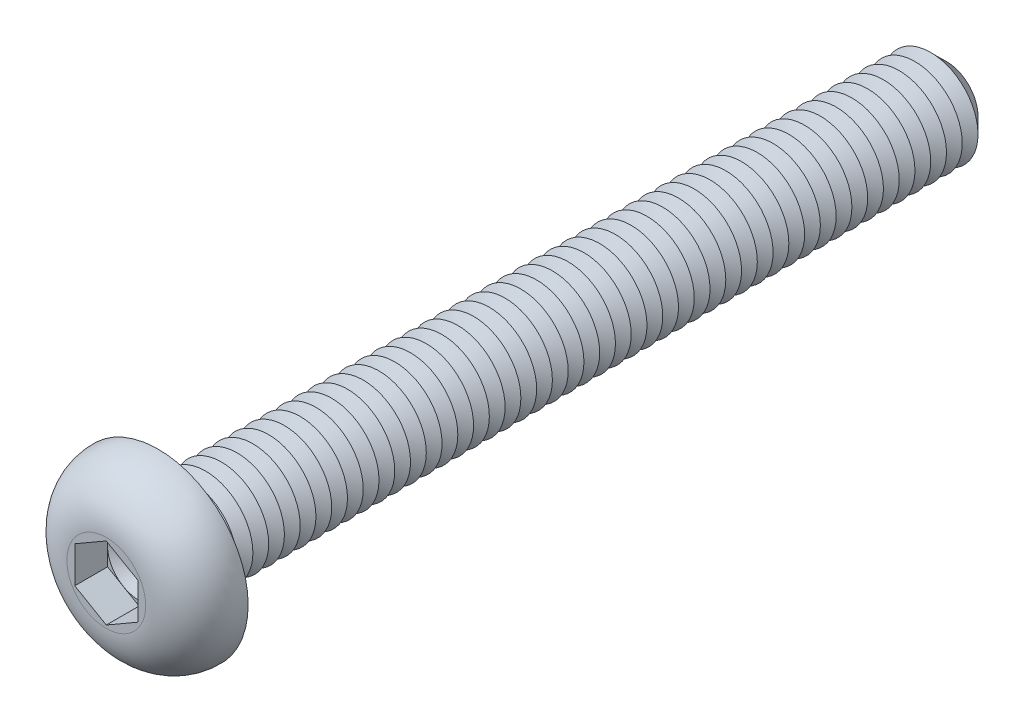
ISO-10303-21;
HEADER;
FILE_DESCRIPTION(('STEP AP214'),'2;1');
FILE_NAME('part.step','',(''),(''),'','','');
FILE_SCHEMA(('AUTOMOTIVE_DESIGN { 1 0 10303 214 1 1 1 1 }'));
ENDSEC;
DATA;
#1=APPLICATION_CONTEXT('core data for automotive mechanical design processes');
#2=APPLICATION_PROTOCOL_DEFINITION('international standard','automotive_design',2000,#1);
#3=PRODUCT_CONTEXT('',#1,'mechanical');
#4=PRODUCT('Part','Part','',(#3));
#5=PRODUCT_RELATED_PRODUCT_CATEGORY('part','',(#4));
#6=PRODUCT_DEFINITION_FORMATION('','',#4);
#7=PRODUCT_DEFINITION_CONTEXT('part definition',#1,'design');
#8=PRODUCT_DEFINITION('design','',#6,#7);
#9=PRODUCT_DEFINITION_SHAPE('','',#8);
#10=(LENGTH_UNIT() NAMED_UNIT(*) SI_UNIT(.MILLI.,.METRE.));
#11=(NAMED_UNIT(*) PLANE_ANGLE_UNIT() SI_UNIT($,.RADIAN.));
#12=(NAMED_UNIT(*) SI_UNIT($,.STERADIAN.) SOLID_ANGLE_UNIT());
#13=UNCERTAINTY_MEASURE_WITH_UNIT(LENGTH_MEASURE(1.E-05),#10,'distance_accuracy_value','');
#14=(GEOMETRIC_REPRESENTATION_CONTEXT(3) GLOBAL_UNCERTAINTY_ASSIGNED_CONTEXT((#13)) GLOBAL_UNIT_ASSIGNED_CONTEXT((#10,
#11,#12)) REPRESENTATION_CONTEXT('',''));
#15=CARTESIAN_POINT('',(0.,0.,0.));
#16=DIRECTION('',(0.,0.,1.));
#17=DIRECTION('',(1.,0.,0.));
#18=AXIS2_PLACEMENT_3D('',#15,#16,#17);
#19=CARTESIAN_POINT('',(0.,0.,0.61));
#20=DIRECTION('',(0.,0.,1.));
#21=DIRECTION('',(1.,0.,0.));
#22=AXIS2_PLACEMENT_3D('',#19,#20,#21);
#23=PLANE('',#22);
#24=CARTESIAN_POINT('',(0.,0.,0.61));
#25=DIRECTION('',(0.,0.,1.));
#26=DIRECTION('',(1.,0.,0.));
#27=AXIS2_PLACEMENT_3D('',#24,#25,#26);
#28=CIRCLE('',#27,1.);
#29=CARTESIAN_POINT('',(1.,0.,0.61));
#30=VERTEX_POINT('',#29);
#31=CARTESIAN_POINT('',(0.5,0.866025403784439,0.61));
#32=VERTEX_POINT('',#31);
#33=EDGE_CURVE('E117',#30,#32,#28,.T.);
#34=ORIENTED_EDGE('',*,*,#33,.F.);
#35=DIRECTION('',(0.,1.,0.));
#36=VECTOR('',#35,1.);
#37=CARTESIAN_POINT('',(1.,-0.577350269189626,0.61));
#38=LINE('',#37,#36);
#39=CARTESIAN_POINT('',(1.,0.577350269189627,0.61));
#40=VERTEX_POINT('',#39);
#41=EDGE_CURVE('E140',#30,#40,#38,.T.);
#42=ORIENTED_EDGE('',*,*,#41,.T.);
#43=DIRECTION('',(-0.866025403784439,0.5,0.));
#44=VECTOR('',#43,1.);
#45=CARTESIAN_POINT('',(1.,0.577350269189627,0.61));
#46=LINE('',#45,#44);
#47=EDGE_CURVE('E135',#40,#32,#46,.T.);
#48=ORIENTED_EDGE('',*,*,#47,.T.);
#49=EDGE_LOOP('',(#34,#42,#48));
#50=FACE_BOUND('',#49,.T.);
#51=ADVANCED_FACE('F39',(#50),#23,.T.);
#52=CARTESIAN_POINT('',(0.,0.,0.61));
#53=DIRECTION('',(0.,0.,1.));
#54=DIRECTION('',(1.,0.,0.));
#55=AXIS2_PLACEMENT_3D('',#52,#53,#54);
#56=CIRCLE('',#55,1.);
#57=CARTESIAN_POINT('',(-0.5,0.866025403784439,0.61));
#58=VERTEX_POINT('',#57);
#59=EDGE_CURVE('E11',#32,#58,#56,.T.);
#60=ORIENTED_EDGE('',*,*,#59,.F.);
#61=CARTESIAN_POINT('',(0.,1.15470053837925,0.61));
#62=VERTEX_POINT('',#61);
#63=EDGE_CURVE('E130',#32,#62,#46,.T.);
#64=ORIENTED_EDGE('',*,*,#63,.T.);
#65=DIRECTION('',(-0.866025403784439,-0.5,0.));
#66=VECTOR('',#65,1.);
#67=CARTESIAN_POINT('',(0.,1.15470053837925,0.61));
#68=LINE('',#67,#66);
#69=EDGE_CURVE('E132',#62,#58,#68,.T.);
#70=ORIENTED_EDGE('',*,*,#69,.T.);
#71=EDGE_LOOP('',(#60,#64,#70));
#72=FACE_BOUND('',#71,.T.);
#73=ADVANCED_FACE('F129',(#72),#23,.T.);
#74=CARTESIAN_POINT('',(-1.,0.,0.61));
#75=VERTEX_POINT('',#74);
#76=EDGE_CURVE('E49',#58,#75,#56,.T.);
#77=ORIENTED_EDGE('',*,*,#76,.F.);
#78=CARTESIAN_POINT('',(-1.,0.577350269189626,0.61));
#79=VERTEX_POINT('',#78);
#80=EDGE_CURVE('E143',#58,#79,#68,.T.);
#81=ORIENTED_EDGE('',*,*,#80,.T.);
#82=DIRECTION('',(0.,-1.,0.));
#83=VECTOR('',#82,1.);
#84=CARTESIAN_POINT('',(-1.,0.577350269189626,0.61));
#85=LINE('',#84,#83);
#86=EDGE_CURVE('E153',#79,#75,#85,.T.);
#87=ORIENTED_EDGE('',*,*,#86,.T.);
#88=EDGE_LOOP('',(#77,#81,#87));
#89=FACE_BOUND('',#88,.T.);
#90=ADVANCED_FACE('F253',(#89),#23,.T.);
#91=CARTESIAN_POINT('',(-0.5,-0.866025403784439,0.61));
#92=VERTEX_POINT('',#91);
#93=EDGE_CURVE('E234',#75,#92,#56,.T.);
#94=ORIENTED_EDGE('',*,*,#93,.F.);
#95=CARTESIAN_POINT('',(-1.,-0.577350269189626,0.61));
#96=VERTEX_POINT('',#95);
#97=EDGE_CURVE('E152',#75,#96,#85,.T.);
#98=ORIENTED_EDGE('',*,*,#97,.T.);
#99=DIRECTION('',(0.866025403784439,-0.5,0.));
#100=VECTOR('',#99,1.);
#101=CARTESIAN_POINT('',(-1.,-0.577350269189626,0.61));
#102=LINE('',#101,#100);
#103=EDGE_CURVE('E158',#96,#92,#102,.T.);
#104=ORIENTED_EDGE('',*,*,#103,.T.);
#105=EDGE_LOOP('',(#94,#98,#104));
#106=FACE_BOUND('',#105,.T.);
#107=ADVANCED_FACE('F246',(#106),#23,.T.);
#108=CARTESIAN_POINT('',(0.5,-0.866025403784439,0.61));
#109=VERTEX_POINT('',#108);
#110=EDGE_CURVE('E56',#92,#109,#56,.T.);
#111=ORIENTED_EDGE('',*,*,#110,.F.);
#112=CARTESIAN_POINT('',(0.,-1.15470053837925,0.61));
#113=VERTEX_POINT('',#112);
#114=EDGE_CURVE('E157',#92,#113,#102,.T.);
#115=ORIENTED_EDGE('',*,*,#114,.T.);
#116=DIRECTION('',(0.866025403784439,0.5,0.));
#117=VECTOR('',#116,1.);
#118=CARTESIAN_POINT('',(0.,-1.15470053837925,0.61));
#119=LINE('',#118,#117);
#120=EDGE_CURVE('E163',#113,#109,#119,.T.);
#121=ORIENTED_EDGE('',*,*,#120,.T.);
#122=EDGE_LOOP('',(#111,#115,#121));
#123=FACE_BOUND('',#122,.T.);
#124=ADVANCED_FACE('F687',(#123),#23,.T.);
#125=CARTESIAN_POINT('',(0.,0.,-25.));
#126=DIRECTION('',(0.,0.,1.));
#127=DIRECTION('',(1.,0.,0.));
#128=AXIS2_PLACEMENT_3D('',#125,#126,#127);
#129=CYLINDRICAL_SURFACE('',#128,1.5);
#130=CARTESIAN_POINT('',(0.,0.,-0.199999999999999));
#131=DIRECTION('',(0.,0.,1.));
#132=DIRECTION('',(1.,0.,0.));
#133=AXIS2_PLACEMENT_3D('',#130,#131,#132);
#134=CIRCLE('',#133,1.5);
#135=CARTESIAN_POINT('',(1.5,0.,-0.199999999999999));
#136=VERTEX_POINT('',#135);
#137=EDGE_CURVE('E221',#136,#136,#134,.F.);
#138=ORIENTED_EDGE('',*,*,#137,.T.);
#139=EDGE_LOOP('',(#138));
#140=FACE_BOUND('',#139,.T.);
#141=CARTESIAN_POINT('',(0.,0.,-0.5));
#142=DIRECTION('',(0.,0.,1.));
#143=DIRECTION('',(1.,0.,0.));
#144=AXIS2_PLACEMENT_3D('',#141,#142,#143);
#145=CIRCLE('',#144,1.50000000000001);
#146=CARTESIAN_POINT('',(1.50000000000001,0.,-0.5));
#147=VERTEX_POINT('',#146);
#148=EDGE_CURVE('E148',#147,#147,#145,.T.);
#149=ORIENTED_EDGE('',*,*,#148,.T.);
#150=EDGE_LOOP('',(#149));
#151=FACE_BOUND('',#150,.T.);
#152=ADVANCED_FACE('F697',(#140,#151),#129,.T.);
#153=CARTESIAN_POINT('',(0.,2.85,0.));
#154=DIRECTION('',(0.,0.,1.));
#155=DIRECTION('',(1.,0.,0.));
#156=AXIS2_PLACEMENT_3D('',#153,#154,#155);
#157=PLANE('',#156);
#158=CARTESIAN_POINT('',(0.,0.,0.));
#159=DIRECTION('',(0.,0.,1.));
#160=DIRECTION('',(1.,0.,0.));
#161=AXIS2_PLACEMENT_3D('',#158,#159,#160);
#162=CIRCLE('',#161,1.7);
#163=CARTESIAN_POINT('',(1.7,0.,0.));
#164=VERTEX_POINT('',#163);
#165=EDGE_CURVE('E224',#164,#164,#162,.T.);
#166=ORIENTED_EDGE('',*,*,#165,.T.);
#167=EDGE_LOOP('',(#166));
#168=FACE_BOUND('',#167,.T.);
#169=CARTESIAN_POINT('',(0.,0.,0.));
#170=DIRECTION('',(0.,0.,1.));
#171=DIRECTION('',(1.,0.,0.));
#172=AXIS2_PLACEMENT_3D('',#169,#170,#171);
#173=CIRCLE('',#172,2.85);
#174=CARTESIAN_POINT('',(2.85,0.,0.));
#175=VERTEX_POINT('',#174);
#176=EDGE_CURVE('E195',#175,#175,#173,.T.);
#177=ORIENTED_EDGE('',*,*,#176,.F.);
#178=EDGE_LOOP('',(#177));
#179=FACE_BOUND('',#178,.T.);
#180=ADVANCED_FACE('F702',(#168,#179),#157,.F.);
#181=CARTESIAN_POINT('',(0.,0.,1.65));
#182=DIRECTION('',(0.,0.,-1.));
#183=DIRECTION('',(-1.,0.,0.));
#184=AXIS2_PLACEMENT_3D('',#181,#182,#183);
#185=PLANE('',#184);
#186=DIRECTION('',(-0.866025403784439,-0.5,0.));
#187=VECTOR('',#186,1.);
#188=CARTESIAN_POINT('',(0.,1.15470053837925,1.65));
#189=LINE('',#188,#187);
#190=CARTESIAN_POINT('',(0.,1.15470053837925,1.65));
#191=VERTEX_POINT('',#190);
#192=CARTESIAN_POINT('',(-1.,0.577350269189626,1.65));
#193=VERTEX_POINT('',#192);
#194=EDGE_CURVE('E173',#191,#193,#189,.T.);
#195=ORIENTED_EDGE('',*,*,#194,.F.);
#196=DIRECTION('',(-0.866025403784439,0.5,0.));
#197=VECTOR('',#196,1.);
#198=CARTESIAN_POINT('',(1.,0.577350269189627,1.65));
#199=LINE('',#198,#197);
#200=CARTESIAN_POINT('',(1.,0.577350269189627,1.65));
#201=VERTEX_POINT('',#200);
#202=EDGE_CURVE('E64',#201,#191,#199,.T.);
#203=ORIENTED_EDGE('',*,*,#202,.F.);
#204=DIRECTION('',(0.,1.,0.));
#205=VECTOR('',#204,1.);
#206=CARTESIAN_POINT('',(1.,-0.577350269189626,1.65));
#207=LINE('',#206,#205);
#208=CARTESIAN_POINT('',(1.,-0.577350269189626,1.65));
#209=VERTEX_POINT('',#208);
#210=EDGE_CURVE('E138',#209,#201,#207,.T.);
#211=ORIENTED_EDGE('',*,*,#210,.F.);
#212=DIRECTION('',(0.866025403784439,0.5,0.));
#213=VECTOR('',#212,1.);
#214=CARTESIAN_POINT('',(0.,-1.15470053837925,1.65));
#215=LINE('',#214,#213);
#216=CARTESIAN_POINT('',(0.,-1.15470053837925,1.65));
#217=VERTEX_POINT('',#216);
#218=EDGE_CURVE('E185',#217,#209,#215,.T.);
#219=ORIENTED_EDGE('',*,*,#218,.F.);
#220=DIRECTION('',(0.866025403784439,-0.5,0.));
#221=VECTOR('',#220,1.);
#222=CARTESIAN_POINT('',(-1.,-0.577350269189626,1.65));
#223=LINE('',#222,#221);
#224=CARTESIAN_POINT('',(-1.,-0.577350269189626,1.65));
#225=VERTEX_POINT('',#224);
#226=EDGE_CURVE('E181',#225,#217,#223,.T.);
#227=ORIENTED_EDGE('',*,*,#226,.F.);
#228=DIRECTION('',(0.,-1.,0.));
#229=VECTOR('',#228,1.);
#230=CARTESIAN_POINT('',(-1.,0.577350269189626,1.65));
#231=LINE('',#230,#229);
#232=EDGE_CURVE('E177',#193,#225,#231,.T.);
#233=ORIENTED_EDGE('',*,*,#232,.F.);
#234=EDGE_LOOP('',(#195,#203,#211,#219,#227,#233));
#235=FACE_BOUND('',#234,.T.);
#236=CARTESIAN_POINT('',(0.,0.,1.65));
#237=DIRECTION('',(0.,0.,1.));
#238=DIRECTION('',(1.,0.,0.));
#239=AXIS2_PLACEMENT_3D('',#236,#237,#238);
#240=CIRCLE('',#239,1.25078144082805);
#241=CARTESIAN_POINT('',(1.25078144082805,0.,1.65));
#242=VERTEX_POINT('',#241);
#243=EDGE_CURVE('E213',#242,#242,#240,.T.);
#244=ORIENTED_EDGE('',*,*,#243,.T.);
#245=EDGE_LOOP('',(#244));
#246=FACE_BOUND('',#245,.T.);
#247=ADVANCED_FACE('F262',(#235,#246),#185,.F.);
#248=CARTESIAN_POINT('',(0.,0.,0.0499999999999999));
#249=DIRECTION('',(0.,0.,1.));
#250=DIRECTION('',(1.,0.,0.));
#251=AXIS2_PLACEMENT_3D('',#248,#249,#250);
#252=DEGENERATE_TOROIDAL_SURFACE('',#251,1.25078144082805,1.6,.T.);
#253=ORIENTED_EDGE('',*,*,#243,.F.);
#254=EDGE_LOOP('',(#253));
#255=FACE_BOUND('',#254,.T.);
#256=ORIENTED_EDGE('',*,*,#176,.T.);
#257=EDGE_LOOP('',(#256));
#258=FACE_BOUND('',#257,.T.);
#259=ADVANCED_FACE('F1710',(#255,#258),#252,.T.);
#260=CARTESIAN_POINT('',(1.,0.577350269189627,0.61));
#261=DIRECTION('',(0.5,0.866025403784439,0.));
#262=DIRECTION('',(-0.866025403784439,0.5,0.));
#263=AXIS2_PLACEMENT_3D('',#260,#261,#262);
#264=PLANE('',#263);
#265=ORIENTED_EDGE('',*,*,#202,.T.);
#266=DIRECTION('',(0.,0.,1.));
#267=VECTOR('',#266,1.);
#268=CARTESIAN_POINT('',(0.,1.15470053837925,0.61));
#269=LINE('',#268,#267);
#270=EDGE_CURVE('E136',#62,#191,#269,.T.);
#271=ORIENTED_EDGE('',*,*,#270,.F.);
#272=ORIENTED_EDGE('',*,*,#63,.F.);
#273=ORIENTED_EDGE('',*,*,#47,.F.);
#274=DIRECTION('',(0.,0.,1.));
#275=VECTOR('',#274,1.);
#276=CARTESIAN_POINT('',(1.,0.577350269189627,0.61));
#277=LINE('',#276,#275);
#278=EDGE_CURVE('E192',#40,#201,#277,.T.);
#279=ORIENTED_EDGE('',*,*,#278,.T.);
#280=EDGE_LOOP('',(#265,#271,#272,#273,#279));
#281=FACE_BOUND('',#280,.T.);
#282=ADVANCED_FACE('F134',(#281),#264,.F.);
#283=CARTESIAN_POINT('',(1.,-0.577350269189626,0.61));
#284=DIRECTION('',(1.,0.,0.));
#285=DIRECTION('',(0.,0.,-1.));
#286=AXIS2_PLACEMENT_3D('',#283,#284,#285);
#287=PLANE('',#286);
#288=ORIENTED_EDGE('',*,*,#210,.T.);
#289=ORIENTED_EDGE('',*,*,#278,.F.);
#290=ORIENTED_EDGE('',*,*,#41,.F.);
#291=CARTESIAN_POINT('',(1.,-0.577350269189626,0.61));
#292=VERTEX_POINT('',#291);
#293=EDGE_CURVE('E167',#292,#30,#38,.T.);
#294=ORIENTED_EDGE('',*,*,#293,.F.);
#295=DIRECTION('',(0.,0.,1.));
#296=VECTOR('',#295,1.);
#297=CARTESIAN_POINT('',(1.,-0.577350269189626,0.61));
#298=LINE('',#297,#296);
#299=EDGE_CURVE('E196',#292,#209,#298,.T.);
#300=ORIENTED_EDGE('',*,*,#299,.T.);
#301=EDGE_LOOP('',(#288,#289,#290,#294,#300));
#302=FACE_BOUND('',#301,.T.);
#303=ADVANCED_FACE('F280',(#302),#287,.F.);
#304=CARTESIAN_POINT('',(0.,-1.15470053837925,0.61));
#305=DIRECTION('',(0.5,-0.866025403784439,0.));
#306=DIRECTION('',(0.866025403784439,0.5,0.));
#307=AXIS2_PLACEMENT_3D('',#304,#305,#306);
#308=PLANE('',#307);
#309=ORIENTED_EDGE('',*,*,#218,.T.);
#310=ORIENTED_EDGE('',*,*,#299,.F.);
#311=EDGE_CURVE('E162',#109,#292,#119,.T.);
#312=ORIENTED_EDGE('',*,*,#311,.F.);
#313=ORIENTED_EDGE('',*,*,#120,.F.);
#314=DIRECTION('',(0.,0.,1.));
#315=VECTOR('',#314,1.);
#316=CARTESIAN_POINT('',(0.,-1.15470053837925,0.61));
#317=LINE('',#316,#315);
#318=EDGE_CURVE('E199',#113,#217,#317,.T.);
#319=ORIENTED_EDGE('',*,*,#318,.T.);
#320=EDGE_LOOP('',(#309,#310,#312,#313,#319));
#321=FACE_BOUND('',#320,.T.);
#322=ADVANCED_FACE('F278',(#321),#308,.F.);
#323=CARTESIAN_POINT('',(-1.,-0.577350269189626,0.61));
#324=DIRECTION('',(-0.5,-0.866025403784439,0.));
#325=DIRECTION('',(0.866025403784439,-0.5,0.));
#326=AXIS2_PLACEMENT_3D('',#323,#324,#325);
#327=PLANE('',#326);
#328=ORIENTED_EDGE('',*,*,#226,.T.);
#329=ORIENTED_EDGE('',*,*,#318,.F.);
#330=ORIENTED_EDGE('',*,*,#114,.F.);
#331=ORIENTED_EDGE('',*,*,#103,.F.);
#332=DIRECTION('',(0.,0.,1.));
#333=VECTOR('',#332,1.);
#334=CARTESIAN_POINT('',(-1.,-0.577350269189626,0.61));
#335=LINE('',#334,#333);
#336=EDGE_CURVE('E202',#96,#225,#335,.T.);
#337=ORIENTED_EDGE('',*,*,#336,.T.);
#338=EDGE_LOOP('',(#328,#329,#330,#331,#337));
#339=FACE_BOUND('',#338,.T.);
#340=ADVANCED_FACE('F267',(#339),#327,.F.);
#341=CARTESIAN_POINT('',(-1.,0.577350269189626,0.61));
#342=DIRECTION('',(-1.,0.,0.));
#343=DIRECTION('',(0.,-1.,0.));
#344=AXIS2_PLACEMENT_3D('',#341,#342,#343);
#345=PLANE('',#344);
#346=ORIENTED_EDGE('',*,*,#232,.T.);
#347=ORIENTED_EDGE('',*,*,#336,.F.);
#348=ORIENTED_EDGE('',*,*,#97,.F.);
#349=ORIENTED_EDGE('',*,*,#86,.F.);
#350=DIRECTION('',(0.,0.,1.));
#351=VECTOR('',#350,1.);
#352=CARTESIAN_POINT('',(-1.,0.577350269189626,0.61));
#353=LINE('',#352,#351);
#354=EDGE_CURVE('E205',#79,#193,#353,.T.);
#355=ORIENTED_EDGE('',*,*,#354,.T.);
#356=EDGE_LOOP('',(#346,#347,#348,#349,#355));
#357=FACE_BOUND('',#356,.T.);
#358=ADVANCED_FACE('F251',(#357),#345,.F.);
#359=CARTESIAN_POINT('',(0.,1.15470053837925,0.61));
#360=DIRECTION('',(-0.5,0.866025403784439,0.));
#361=DIRECTION('',(-0.866025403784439,-0.5,0.));
#362=AXIS2_PLACEMENT_3D('',#359,#360,#361);
#363=PLANE('',#362);
#364=ORIENTED_EDGE('',*,*,#194,.T.);
#365=ORIENTED_EDGE('',*,*,#354,.F.);
#366=ORIENTED_EDGE('',*,*,#80,.F.);
#367=ORIENTED_EDGE('',*,*,#69,.F.);
#368=ORIENTED_EDGE('',*,*,#270,.T.);
#369=EDGE_LOOP('',(#364,#365,#366,#367,#368));
#370=FACE_BOUND('',#369,.T.);
#371=ADVANCED_FACE('F256',(#370),#363,.F.);
#372=EDGE_CURVE('E43',#109,#30,#56,.T.);
#373=ORIENTED_EDGE('',*,*,#372,.F.);
#374=ORIENTED_EDGE('',*,*,#311,.T.);
#375=ORIENTED_EDGE('',*,*,#293,.T.);
#376=EDGE_LOOP('',(#373,#374,#375));
#377=FACE_BOUND('',#376,.T.);
#378=ADVANCED_FACE('F275',(#377),#23,.T.);
#379=CARTESIAN_POINT('',(0.,0.,-0.5));
#380=DIRECTION('',(0.,0.,1.));
#381=DIRECTION('',(1.,0.,0.));
#382=AXIS2_PLACEMENT_3D('',#379,#380,#381);
#383=CONICAL_SURFACE('',#382,1.50000000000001,1.0471975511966);
#384=CARTESIAN_POINT('',(0.,0.,-0.750000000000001));
#385=DIRECTION('',(0.,0.,1.));
#386=DIRECTION('',(1.,0.,0.));
#387=AXIS2_PLACEMENT_3D('',#384,#385,#386);
#388=CIRCLE('',#387,1.06698729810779);
#389=CARTESIAN_POINT('',(1.06698729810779,0.,-0.750000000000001));
#390=VERTEX_POINT('',#389);
#391=EDGE_CURVE('E321',#390,#390,#388,.T.);
#392=ORIENTED_EDGE('',*,*,#391,.T.);
#393=EDGE_LOOP('',(#392));
#394=FACE_BOUND('',#393,.T.);
#395=ORIENTED_EDGE('',*,*,#148,.F.);
#396=EDGE_LOOP('',(#395));
#397=FACE_BOUND('',#396,.T.);
#398=ADVANCED_FACE('F686',(#394,#397),#383,.T.);
#399=CARTESIAN_POINT('',(0.,0.,-0.750000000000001));
#400=DIRECTION('',(0.,0.,-1.));
#401=DIRECTION('',(-1.,0.,0.));
#402=AXIS2_PLACEMENT_3D('',#399,#400,#401);
#403=CONICAL_SURFACE('',#402,1.06698729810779,1.0471975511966);
#404=CARTESIAN_POINT('',(0.,0.,-1.));
#405=DIRECTION('',(0.,0.,1.));
#406=DIRECTION('',(1.,0.,0.));
#407=AXIS2_PLACEMENT_3D('',#404,#405,#406);
#408=CIRCLE('',#407,1.50000000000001);
#409=CARTESIAN_POINT('',(1.50000000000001,0.,-1.));
#410=VERTEX_POINT('',#409);
#411=EDGE_CURVE('E319',#410,#410,#408,.T.);
#412=ORIENTED_EDGE('',*,*,#411,.T.);
#413=EDGE_LOOP('',(#412));
#414=FACE_BOUND('',#413,.T.);
#415=ORIENTED_EDGE('',*,*,#391,.F.);
#416=EDGE_LOOP('',(#415));
#417=FACE_BOUND('',#416,.T.);
#418=ADVANCED_FACE('F692',(#414,#417),#403,.T.);
#419=CARTESIAN_POINT('',(0.,0.,-1.));
#420=DIRECTION('',(0.,0.,1.));
#421=DIRECTION('',(1.,0.,0.));
#422=AXIS2_PLACEMENT_3D('',#419,#420,#421);
#423=CONICAL_SURFACE('',#422,1.50000000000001,1.0471975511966);
#424=CARTESIAN_POINT('',(0.,0.,-1.25));
#425=DIRECTION('',(0.,0.,1.));
#426=DIRECTION('',(1.,0.,0.));
#427=AXIS2_PLACEMENT_3D('',#424,#425,#426);
#428=CIRCLE('',#427,1.06698729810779);
#429=CARTESIAN_POINT('',(1.06698729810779,0.,-1.25));
#430=VERTEX_POINT('',#429);
#431=EDGE_CURVE('E322',#430,#430,#428,.T.);
#432=ORIENTED_EDGE('',*,*,#431,.T.);
#433=EDGE_LOOP('',(#432));
#434=FACE_BOUND('',#433,.T.);
#435=ORIENTED_EDGE('',*,*,#411,.F.);
#436=EDGE_LOOP('',(#435));
#437=FACE_BOUND('',#436,.T.);
#438=ADVANCED_FACE('F1668',(#434,#437),#423,.T.);
#439=CARTESIAN_POINT('',(0.,0.,-1.25));
#440=DIRECTION('',(0.,0.,-1.));
#441=DIRECTION('',(-1.,0.,0.));
#442=AXIS2_PLACEMENT_3D('',#439,#440,#441);
#443=CONICAL_SURFACE('',#442,1.06698729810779,1.0471975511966);
#444=CARTESIAN_POINT('',(0.,0.,-1.5));
#445=DIRECTION('',(0.,0.,1.));
#446=DIRECTION('',(1.,0.,0.));
#447=AXIS2_PLACEMENT_3D('',#444,#445,#446);
#448=CIRCLE('',#447,1.50000000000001);
#449=CARTESIAN_POINT('',(1.50000000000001,0.,-1.5));
#450=VERTEX_POINT('',#449);
#451=EDGE_CURVE('E330',#450,#450,#448,.T.);
#452=ORIENTED_EDGE('',*,*,#451,.T.);
#453=EDGE_LOOP('',(#452));
#454=FACE_BOUND('',#453,.T.);
#455=ORIENTED_EDGE('',*,*,#431,.F.);
#456=EDGE_LOOP('',(#455));
#457=FACE_BOUND('',#456,.T.);
#458=ADVANCED_FACE('F1658',(#454,#457),#443,.T.);
#459=CARTESIAN_POINT('',(0.,0.,-1.5));
#460=DIRECTION('',(0.,0.,1.));
#461=DIRECTION('',(1.,0.,0.));
#462=AXIS2_PLACEMENT_3D('',#459,#460,#461);
#463=CONICAL_SURFACE('',#462,1.50000000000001,1.0471975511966);
#464=CARTESIAN_POINT('',(0.,0.,-1.75));
#465=DIRECTION('',(0.,0.,1.));
#466=DIRECTION('',(1.,0.,0.));
#467=AXIS2_PLACEMENT_3D('',#464,#465,#466);
#468=CIRCLE('',#467,1.06698729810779);
#469=CARTESIAN_POINT('',(1.06698729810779,0.,-1.75));
#470=VERTEX_POINT('',#469);
#471=EDGE_CURVE('E336',#470,#470,#468,.T.);
#472=ORIENTED_EDGE('',*,*,#471,.T.);
#473=EDGE_LOOP('',(#472));
#474=FACE_BOUND('',#473,.T.);
#475=ORIENTED_EDGE('',*,*,#451,.F.);
#476=EDGE_LOOP('',(#475));
#477=FACE_BOUND('',#476,.T.);
#478=ADVANCED_FACE('F1648',(#474,#477),#463,.T.);
#479=CARTESIAN_POINT('',(0.,0.,-1.75));
#480=DIRECTION('',(0.,0.,-1.));
#481=DIRECTION('',(-1.,0.,0.));
#482=AXIS2_PLACEMENT_3D('',#479,#480,#481);
#483=CONICAL_SURFACE('',#482,1.06698729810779,1.0471975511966);
#484=CARTESIAN_POINT('',(0.,0.,-2.));
#485=DIRECTION('',(0.,0.,1.));
#486=DIRECTION('',(1.,0.,0.));
#487=AXIS2_PLACEMENT_3D('',#484,#485,#486);
#488=CIRCLE('',#487,1.50000000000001);
#489=CARTESIAN_POINT('',(1.50000000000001,0.,-2.));
#490=VERTEX_POINT('',#489);
#491=EDGE_CURVE('E340',#490,#490,#488,.T.);
#492=ORIENTED_EDGE('',*,*,#491,.T.);
#493=EDGE_LOOP('',(#492));
#494=FACE_BOUND('',#493,.T.);
#495=ORIENTED_EDGE('',*,*,#471,.F.);
#496=EDGE_LOOP('',(#495));
#497=FACE_BOUND('',#496,.T.);
#498=ADVANCED_FACE('F1638',(#494,#497),#483,.T.);
#499=CARTESIAN_POINT('',(0.,0.,-2.));
#500=DIRECTION('',(0.,0.,1.));
#501=DIRECTION('',(1.,0.,0.));
#502=AXIS2_PLACEMENT_3D('',#499,#500,#501);
#503=CONICAL_SURFACE('',#502,1.50000000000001,1.0471975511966);
#504=CARTESIAN_POINT('',(0.,0.,-2.25));
#505=DIRECTION('',(0.,0.,1.));
#506=DIRECTION('',(1.,0.,0.));
#507=AXIS2_PLACEMENT_3D('',#504,#505,#506);
#508=CIRCLE('',#507,1.06698729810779);
#509=CARTESIAN_POINT('',(1.06698729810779,0.,-2.25));
#510=VERTEX_POINT('',#509);
#511=EDGE_CURVE('E344',#510,#510,#508,.T.);
#512=ORIENTED_EDGE('',*,*,#511,.T.);
#513=EDGE_LOOP('',(#512));
#514=FACE_BOUND('',#513,.T.);
#515=ORIENTED_EDGE('',*,*,#491,.F.);
#516=EDGE_LOOP('',(#515));
#517=FACE_BOUND('',#516,.T.);
#518=ADVANCED_FACE('F1628',(#514,#517),#503,.T.);
#519=CARTESIAN_POINT('',(0.,0.,-2.25));
#520=DIRECTION('',(0.,0.,-1.));
#521=DIRECTION('',(-1.,0.,0.));
#522=AXIS2_PLACEMENT_3D('',#519,#520,#521);
#523=CONICAL_SURFACE('',#522,1.06698729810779,1.0471975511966);
#524=CARTESIAN_POINT('',(0.,0.,-2.5));
#525=DIRECTION('',(0.,0.,1.));
#526=DIRECTION('',(1.,0.,0.));
#527=AXIS2_PLACEMENT_3D('',#524,#525,#526);
#528=CIRCLE('',#527,1.50000000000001);
#529=CARTESIAN_POINT('',(1.50000000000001,0.,-2.5));
#530=VERTEX_POINT('',#529);
#531=EDGE_CURVE('E348',#530,#530,#528,.T.);
#532=ORIENTED_EDGE('',*,*,#531,.T.);
#533=EDGE_LOOP('',(#532));
#534=FACE_BOUND('',#533,.T.);
#535=ORIENTED_EDGE('',*,*,#511,.F.);
#536=EDGE_LOOP('',(#535));
#537=FACE_BOUND('',#536,.T.);
#538=ADVANCED_FACE('F1618',(#534,#537),#523,.T.);
#539=CARTESIAN_POINT('',(0.,0.,-2.5));
#540=DIRECTION('',(0.,0.,1.));
#541=DIRECTION('',(1.,0.,0.));
#542=AXIS2_PLACEMENT_3D('',#539,#540,#541);
#543=CONICAL_SURFACE('',#542,1.50000000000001,1.0471975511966);
#544=CARTESIAN_POINT('',(0.,0.,-2.75));
#545=DIRECTION('',(0.,0.,1.));
#546=DIRECTION('',(1.,0.,0.));
#547=AXIS2_PLACEMENT_3D('',#544,#545,#546);
#548=CIRCLE('',#547,1.06698729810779);
#549=CARTESIAN_POINT('',(1.06698729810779,0.,-2.75));
#550=VERTEX_POINT('',#549);
#551=EDGE_CURVE('E352',#550,#550,#548,.T.);
#552=ORIENTED_EDGE('',*,*,#551,.T.);
#553=EDGE_LOOP('',(#552));
#554=FACE_BOUND('',#553,.T.);
#555=ORIENTED_EDGE('',*,*,#531,.F.);
#556=EDGE_LOOP('',(#555));
#557=FACE_BOUND('',#556,.T.);
#558=ADVANCED_FACE('F1608',(#554,#557),#543,.T.);
#559=CARTESIAN_POINT('',(0.,0.,-2.75));
#560=DIRECTION('',(0.,0.,-1.));
#561=DIRECTION('',(-1.,0.,0.));
#562=AXIS2_PLACEMENT_3D('',#559,#560,#561);
#563=CONICAL_SURFACE('',#562,1.06698729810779,1.0471975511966);
#564=CARTESIAN_POINT('',(0.,0.,-3.));
#565=DIRECTION('',(0.,0.,1.));
#566=DIRECTION('',(1.,0.,0.));
#567=AXIS2_PLACEMENT_3D('',#564,#565,#566);
#568=CIRCLE('',#567,1.50000000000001);
#569=CARTESIAN_POINT('',(1.50000000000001,0.,-3.));
#570=VERTEX_POINT('',#569);
#571=EDGE_CURVE('E356',#570,#570,#568,.T.);
#572=ORIENTED_EDGE('',*,*,#571,.T.);
#573=EDGE_LOOP('',(#572));
#574=FACE_BOUND('',#573,.T.);
#575=ORIENTED_EDGE('',*,*,#551,.F.);
#576=EDGE_LOOP('',(#575));
#577=FACE_BOUND('',#576,.T.);
#578=ADVANCED_FACE('F1598',(#574,#577),#563,.T.);
#579=CARTESIAN_POINT('',(0.,0.,-3.));
#580=DIRECTION('',(0.,0.,1.));
#581=DIRECTION('',(1.,0.,0.));
#582=AXIS2_PLACEMENT_3D('',#579,#580,#581);
#583=CONICAL_SURFACE('',#582,1.50000000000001,1.0471975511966);
#584=CARTESIAN_POINT('',(0.,0.,-3.25));
#585=DIRECTION('',(0.,0.,1.));
#586=DIRECTION('',(1.,0.,0.));
#587=AXIS2_PLACEMENT_3D('',#584,#585,#586);
#588=CIRCLE('',#587,1.06698729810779);
#589=CARTESIAN_POINT('',(1.06698729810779,0.,-3.25));
#590=VERTEX_POINT('',#589);
#591=EDGE_CURVE('E360',#590,#590,#588,.T.);
#592=ORIENTED_EDGE('',*,*,#591,.T.);
#593=EDGE_LOOP('',(#592));
#594=FACE_BOUND('',#593,.T.);
#595=ORIENTED_EDGE('',*,*,#571,.F.);
#596=EDGE_LOOP('',(#595));
#597=FACE_BOUND('',#596,.T.);
#598=ADVANCED_FACE('F1588',(#594,#597),#583,.T.);
#599=CARTESIAN_POINT('',(0.,0.,-3.25));
#600=DIRECTION('',(0.,0.,-1.));
#601=DIRECTION('',(-1.,0.,0.));
#602=AXIS2_PLACEMENT_3D('',#599,#600,#601);
#603=CONICAL_SURFACE('',#602,1.06698729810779,1.0471975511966);
#604=CARTESIAN_POINT('',(0.,0.,-3.5));
#605=DIRECTION('',(0.,0.,1.));
#606=DIRECTION('',(1.,0.,0.));
#607=AXIS2_PLACEMENT_3D('',#604,#605,#606);
#608=CIRCLE('',#607,1.50000000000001);
#609=CARTESIAN_POINT('',(1.50000000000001,0.,-3.5));
#610=VERTEX_POINT('',#609);
#611=EDGE_CURVE('E363',#610,#610,#608,.T.);
#612=ORIENTED_EDGE('',*,*,#611,.T.);
#613=EDGE_LOOP('',(#612));
#614=FACE_BOUND('',#613,.T.);
#615=ORIENTED_EDGE('',*,*,#591,.F.);
#616=EDGE_LOOP('',(#615));
#617=FACE_BOUND('',#616,.T.);
#618=ADVANCED_FACE('F1578',(#614,#617),#603,.T.);
#619=CARTESIAN_POINT('',(0.,0.,-3.5));
#620=DIRECTION('',(0.,0.,1.));
#621=DIRECTION('',(1.,0.,0.));
#622=AXIS2_PLACEMENT_3D('',#619,#620,#621);
#623=CONICAL_SURFACE('',#622,1.50000000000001,1.0471975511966);
#624=CARTESIAN_POINT('',(0.,0.,-3.75));
#625=DIRECTION('',(0.,0.,1.));
#626=DIRECTION('',(1.,0.,0.));
#627=AXIS2_PLACEMENT_3D('',#624,#625,#626);
#628=CIRCLE('',#627,1.06698729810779);
#629=CARTESIAN_POINT('',(1.06698729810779,0.,-3.75));
#630=VERTEX_POINT('',#629);
#631=EDGE_CURVE('E367',#630,#630,#628,.T.);
#632=ORIENTED_EDGE('',*,*,#631,.T.);
#633=EDGE_LOOP('',(#632));
#634=FACE_BOUND('',#633,.T.);
#635=ORIENTED_EDGE('',*,*,#611,.F.);
#636=EDGE_LOOP('',(#635));
#637=FACE_BOUND('',#636,.T.);
#638=ADVANCED_FACE('F1568',(#634,#637),#623,.T.);
#639=CARTESIAN_POINT('',(0.,0.,-3.75));
#640=DIRECTION('',(0.,0.,-1.));
#641=DIRECTION('',(-1.,0.,0.));
#642=AXIS2_PLACEMENT_3D('',#639,#640,#641);
#643=CONICAL_SURFACE('',#642,1.06698729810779,1.0471975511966);
#644=CARTESIAN_POINT('',(0.,0.,-4.));
#645=DIRECTION('',(0.,0.,1.));
#646=DIRECTION('',(1.,0.,0.));
#647=AXIS2_PLACEMENT_3D('',#644,#645,#646);
#648=CIRCLE('',#647,1.50000000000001);
#649=CARTESIAN_POINT('',(1.50000000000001,0.,-4.));
#650=VERTEX_POINT('',#649);
#651=EDGE_CURVE('E371',#650,#650,#648,.T.);
#652=ORIENTED_EDGE('',*,*,#651,.T.);
#653=EDGE_LOOP('',(#652));
#654=FACE_BOUND('',#653,.T.);
#655=ORIENTED_EDGE('',*,*,#631,.F.);
#656=EDGE_LOOP('',(#655));
#657=FACE_BOUND('',#656,.T.);
#658=ADVANCED_FACE('F1558',(#654,#657),#643,.T.);
#659=CARTESIAN_POINT('',(0.,0.,-4.));
#660=DIRECTION('',(0.,0.,1.));
#661=DIRECTION('',(1.,0.,0.));
#662=AXIS2_PLACEMENT_3D('',#659,#660,#661);
#663=CONICAL_SURFACE('',#662,1.50000000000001,1.0471975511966);
#664=CARTESIAN_POINT('',(0.,0.,-4.25));
#665=DIRECTION('',(0.,0.,1.));
#666=DIRECTION('',(1.,0.,0.));
#667=AXIS2_PLACEMENT_3D('',#664,#665,#666);
#668=CIRCLE('',#667,1.06698729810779);
#669=CARTESIAN_POINT('',(1.06698729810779,0.,-4.25));
#670=VERTEX_POINT('',#669);
#671=EDGE_CURVE('E375',#670,#670,#668,.T.);
#672=ORIENTED_EDGE('',*,*,#671,.T.);
#673=EDGE_LOOP('',(#672));
#674=FACE_BOUND('',#673,.T.);
#675=ORIENTED_EDGE('',*,*,#651,.F.);
#676=EDGE_LOOP('',(#675));
#677=FACE_BOUND('',#676,.T.);
#678=ADVANCED_FACE('F1548',(#674,#677),#663,.T.);
#679=CARTESIAN_POINT('',(0.,0.,-4.25));
#680=DIRECTION('',(0.,0.,-1.));
#681=DIRECTION('',(-1.,0.,0.));
#682=AXIS2_PLACEMENT_3D('',#679,#680,#681);
#683=CONICAL_SURFACE('',#682,1.06698729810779,1.0471975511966);
#684=CARTESIAN_POINT('',(0.,0.,-4.5));
#685=DIRECTION('',(0.,0.,1.));
#686=DIRECTION('',(1.,0.,0.));
#687=AXIS2_PLACEMENT_3D('',#684,#685,#686);
#688=CIRCLE('',#687,1.50000000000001);
#689=CARTESIAN_POINT('',(1.50000000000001,0.,-4.5));
#690=VERTEX_POINT('',#689);
#691=EDGE_CURVE('E379',#690,#690,#688,.T.);
#692=ORIENTED_EDGE('',*,*,#691,.T.);
#693=EDGE_LOOP('',(#692));
#694=FACE_BOUND('',#693,.T.);
#695=ORIENTED_EDGE('',*,*,#671,.F.);
#696=EDGE_LOOP('',(#695));
#697=FACE_BOUND('',#696,.T.);
#698=ADVANCED_FACE('F1538',(#694,#697),#683,.T.);
#699=CARTESIAN_POINT('',(0.,0.,-4.5));
#700=DIRECTION('',(0.,0.,1.));
#701=DIRECTION('',(1.,0.,0.));
#702=AXIS2_PLACEMENT_3D('',#699,#700,#701);
#703=CONICAL_SURFACE('',#702,1.50000000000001,1.0471975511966);
#704=CARTESIAN_POINT('',(0.,0.,-4.75));
#705=DIRECTION('',(0.,0.,1.));
#706=DIRECTION('',(1.,0.,0.));
#707=AXIS2_PLACEMENT_3D('',#704,#705,#706);
#708=CIRCLE('',#707,1.06698729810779);
#709=CARTESIAN_POINT('',(1.06698729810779,0.,-4.75));
#710=VERTEX_POINT('',#709);
#711=EDGE_CURVE('E383',#710,#710,#708,.T.);
#712=ORIENTED_EDGE('',*,*,#711,.T.);
#713=EDGE_LOOP('',(#712));
#714=FACE_BOUND('',#713,.T.);
#715=ORIENTED_EDGE('',*,*,#691,.F.);
#716=EDGE_LOOP('',(#715));
#717=FACE_BOUND('',#716,.T.);
#718=ADVANCED_FACE('F1528',(#714,#717),#703,.T.);
#719=CARTESIAN_POINT('',(0.,0.,-4.75));
#720=DIRECTION('',(0.,0.,-1.));
#721=DIRECTION('',(-1.,0.,0.));
#722=AXIS2_PLACEMENT_3D('',#719,#720,#721);
#723=CONICAL_SURFACE('',#722,1.06698729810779,1.0471975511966);
#724=CARTESIAN_POINT('',(0.,0.,-5.));
#725=DIRECTION('',(0.,0.,1.));
#726=DIRECTION('',(1.,0.,0.));
#727=AXIS2_PLACEMENT_3D('',#724,#725,#726);
#728=CIRCLE('',#727,1.50000000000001);
#729=CARTESIAN_POINT('',(1.50000000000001,0.,-5.));
#730=VERTEX_POINT('',#729);
#731=EDGE_CURVE('E387',#730,#730,#728,.T.);
#732=ORIENTED_EDGE('',*,*,#731,.T.);
#733=EDGE_LOOP('',(#732));
#734=FACE_BOUND('',#733,.T.);
#735=ORIENTED_EDGE('',*,*,#711,.F.);
#736=EDGE_LOOP('',(#735));
#737=FACE_BOUND('',#736,.T.);
#738=ADVANCED_FACE('F1518',(#734,#737),#723,.T.);
#739=CARTESIAN_POINT('',(0.,0.,-5.));
#740=DIRECTION('',(0.,0.,1.));
#741=DIRECTION('',(1.,0.,0.));
#742=AXIS2_PLACEMENT_3D('',#739,#740,#741);
#743=CONICAL_SURFACE('',#742,1.50000000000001,1.0471975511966);
#744=CARTESIAN_POINT('',(0.,0.,-5.25));
#745=DIRECTION('',(0.,0.,1.));
#746=DIRECTION('',(1.,0.,0.));
#747=AXIS2_PLACEMENT_3D('',#744,#745,#746);
#748=CIRCLE('',#747,1.06698729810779);
#749=CARTESIAN_POINT('',(1.06698729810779,0.,-5.25));
#750=VERTEX_POINT('',#749);
#751=EDGE_CURVE('E391',#750,#750,#748,.T.);
#752=ORIENTED_EDGE('',*,*,#751,.T.);
#753=EDGE_LOOP('',(#752));
#754=FACE_BOUND('',#753,.T.);
#755=ORIENTED_EDGE('',*,*,#731,.F.);
#756=EDGE_LOOP('',(#755));
#757=FACE_BOUND('',#756,.T.);
#758=ADVANCED_FACE('F1508',(#754,#757),#743,.T.);
#759=CARTESIAN_POINT('',(0.,0.,-5.25));
#760=DIRECTION('',(0.,0.,-1.));
#761=DIRECTION('',(-1.,0.,0.));
#762=AXIS2_PLACEMENT_3D('',#759,#760,#761);
#763=CONICAL_SURFACE('',#762,1.06698729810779,1.0471975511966);
#764=CARTESIAN_POINT('',(0.,0.,-5.5));
#765=DIRECTION('',(0.,0.,1.));
#766=DIRECTION('',(1.,0.,0.));
#767=AXIS2_PLACEMENT_3D('',#764,#765,#766);
#768=CIRCLE('',#767,1.50000000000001);
#769=CARTESIAN_POINT('',(1.50000000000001,0.,-5.5));
#770=VERTEX_POINT('',#769);
#771=EDGE_CURVE('E395',#770,#770,#768,.T.);
#772=ORIENTED_EDGE('',*,*,#771,.T.);
#773=EDGE_LOOP('',(#772));
#774=FACE_BOUND('',#773,.T.);
#775=ORIENTED_EDGE('',*,*,#751,.F.);
#776=EDGE_LOOP('',(#775));
#777=FACE_BOUND('',#776,.T.);
#778=ADVANCED_FACE('F1498',(#774,#777),#763,.T.);
#779=CARTESIAN_POINT('',(0.,0.,-5.5));
#780=DIRECTION('',(0.,0.,1.));
#781=DIRECTION('',(1.,0.,0.));
#782=AXIS2_PLACEMENT_3D('',#779,#780,#781);
#783=CONICAL_SURFACE('',#782,1.50000000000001,1.0471975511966);
#784=CARTESIAN_POINT('',(0.,0.,-5.75));
#785=DIRECTION('',(0.,0.,1.));
#786=DIRECTION('',(1.,0.,0.));
#787=AXIS2_PLACEMENT_3D('',#784,#785,#786);
#788=CIRCLE('',#787,1.06698729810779);
#789=CARTESIAN_POINT('',(1.06698729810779,0.,-5.75));
#790=VERTEX_POINT('',#789);
#791=EDGE_CURVE('E399',#790,#790,#788,.T.);
#792=ORIENTED_EDGE('',*,*,#791,.T.);
#793=EDGE_LOOP('',(#792));
#794=FACE_BOUND('',#793,.T.);
#795=ORIENTED_EDGE('',*,*,#771,.F.);
#796=EDGE_LOOP('',(#795));
#797=FACE_BOUND('',#796,.T.);
#798=ADVANCED_FACE('F1488',(#794,#797),#783,.T.);
#799=CARTESIAN_POINT('',(0.,0.,-5.75));
#800=DIRECTION('',(0.,0.,-1.));
#801=DIRECTION('',(-1.,0.,0.));
#802=AXIS2_PLACEMENT_3D('',#799,#800,#801);
#803=CONICAL_SURFACE('',#802,1.06698729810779,1.0471975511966);
#804=CARTESIAN_POINT('',(0.,0.,-6.));
#805=DIRECTION('',(0.,0.,1.));
#806=DIRECTION('',(1.,0.,0.));
#807=AXIS2_PLACEMENT_3D('',#804,#805,#806);
#808=CIRCLE('',#807,1.50000000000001);
#809=CARTESIAN_POINT('',(1.50000000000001,0.,-6.));
#810=VERTEX_POINT('',#809);
#811=EDGE_CURVE('E403',#810,#810,#808,.T.);
#812=ORIENTED_EDGE('',*,*,#811,.T.);
#813=EDGE_LOOP('',(#812));
#814=FACE_BOUND('',#813,.T.);
#815=ORIENTED_EDGE('',*,*,#791,.F.);
#816=EDGE_LOOP('',(#815));
#817=FACE_BOUND('',#816,.T.);
#818=ADVANCED_FACE('F1478',(#814,#817),#803,.T.);
#819=CARTESIAN_POINT('',(0.,0.,-6.));
#820=DIRECTION('',(0.,0.,1.));
#821=DIRECTION('',(1.,0.,0.));
#822=AXIS2_PLACEMENT_3D('',#819,#820,#821);
#823=CONICAL_SURFACE('',#822,1.50000000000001,1.0471975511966);
#824=CARTESIAN_POINT('',(0.,0.,-6.25));
#825=DIRECTION('',(0.,0.,1.));
#826=DIRECTION('',(1.,0.,0.));
#827=AXIS2_PLACEMENT_3D('',#824,#825,#826);
#828=CIRCLE('',#827,1.06698729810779);
#829=CARTESIAN_POINT('',(1.06698729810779,0.,-6.25));
#830=VERTEX_POINT('',#829);
#831=EDGE_CURVE('E407',#830,#830,#828,.T.);
#832=ORIENTED_EDGE('',*,*,#831,.T.);
#833=EDGE_LOOP('',(#832));
#834=FACE_BOUND('',#833,.T.);
#835=ORIENTED_EDGE('',*,*,#811,.F.);
#836=EDGE_LOOP('',(#835));
#837=FACE_BOUND('',#836,.T.);
#838=ADVANCED_FACE('F1468',(#834,#837),#823,.T.);
#839=CARTESIAN_POINT('',(0.,0.,-6.25));
#840=DIRECTION('',(0.,0.,-1.));
#841=DIRECTION('',(-1.,0.,0.));
#842=AXIS2_PLACEMENT_3D('',#839,#840,#841);
#843=CONICAL_SURFACE('',#842,1.06698729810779,1.0471975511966);
#844=CARTESIAN_POINT('',(0.,0.,-6.5));
#845=DIRECTION('',(0.,0.,1.));
#846=DIRECTION('',(1.,0.,0.));
#847=AXIS2_PLACEMENT_3D('',#844,#845,#846);
#848=CIRCLE('',#847,1.50000000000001);
#849=CARTESIAN_POINT('',(1.50000000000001,0.,-6.5));
#850=VERTEX_POINT('',#849);
#851=EDGE_CURVE('E411',#850,#850,#848,.T.);
#852=ORIENTED_EDGE('',*,*,#851,.T.);
#853=EDGE_LOOP('',(#852));
#854=FACE_BOUND('',#853,.T.);
#855=ORIENTED_EDGE('',*,*,#831,.F.);
#856=EDGE_LOOP('',(#855));
#857=FACE_BOUND('',#856,.T.);
#858=ADVANCED_FACE('F1458',(#854,#857),#843,.T.);
#859=CARTESIAN_POINT('',(0.,0.,-6.5));
#860=DIRECTION('',(0.,0.,1.));
#861=DIRECTION('',(1.,0.,0.));
#862=AXIS2_PLACEMENT_3D('',#859,#860,#861);
#863=CONICAL_SURFACE('',#862,1.50000000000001,1.0471975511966);
#864=CARTESIAN_POINT('',(0.,0.,-6.75));
#865=DIRECTION('',(0.,0.,1.));
#866=DIRECTION('',(1.,0.,0.));
#867=AXIS2_PLACEMENT_3D('',#864,#865,#866);
#868=CIRCLE('',#867,1.06698729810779);
#869=CARTESIAN_POINT('',(1.06698729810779,0.,-6.75));
#870=VERTEX_POINT('',#869);
#871=EDGE_CURVE('E415',#870,#870,#868,.T.);
#872=ORIENTED_EDGE('',*,*,#871,.T.);
#873=EDGE_LOOP('',(#872));
#874=FACE_BOUND('',#873,.T.);
#875=ORIENTED_EDGE('',*,*,#851,.F.);
#876=EDGE_LOOP('',(#875));
#877=FACE_BOUND('',#876,.T.);
#878=ADVANCED_FACE('F1448',(#874,#877),#863,.T.);
#879=CARTESIAN_POINT('',(0.,0.,-6.75));
#880=DIRECTION('',(0.,0.,-1.));
#881=DIRECTION('',(-1.,0.,0.));
#882=AXIS2_PLACEMENT_3D('',#879,#880,#881);
#883=CONICAL_SURFACE('',#882,1.06698729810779,1.0471975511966);
#884=CARTESIAN_POINT('',(0.,0.,-7.));
#885=DIRECTION('',(0.,0.,1.));
#886=DIRECTION('',(1.,0.,0.));
#887=AXIS2_PLACEMENT_3D('',#884,#885,#886);
#888=CIRCLE('',#887,1.50000000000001);
#889=CARTESIAN_POINT('',(1.50000000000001,0.,-7.));
#890=VERTEX_POINT('',#889);
#891=EDGE_CURVE('E419',#890,#890,#888,.T.);
#892=ORIENTED_EDGE('',*,*,#891,.T.);
#893=EDGE_LOOP('',(#892));
#894=FACE_BOUND('',#893,.T.);
#895=ORIENTED_EDGE('',*,*,#871,.F.);
#896=EDGE_LOOP('',(#895));
#897=FACE_BOUND('',#896,.T.);
#898=ADVANCED_FACE('F1438',(#894,#897),#883,.T.);
#899=CARTESIAN_POINT('',(0.,0.,-7.));
#900=DIRECTION('',(0.,0.,1.));
#901=DIRECTION('',(1.,0.,0.));
#902=AXIS2_PLACEMENT_3D('',#899,#900,#901);
#903=CONICAL_SURFACE('',#902,1.50000000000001,1.0471975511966);
#904=CARTESIAN_POINT('',(0.,0.,-7.25));
#905=DIRECTION('',(0.,0.,1.));
#906=DIRECTION('',(1.,0.,0.));
#907=AXIS2_PLACEMENT_3D('',#904,#905,#906);
#908=CIRCLE('',#907,1.06698729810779);
#909=CARTESIAN_POINT('',(1.06698729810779,0.,-7.25));
#910=VERTEX_POINT('',#909);
#911=EDGE_CURVE('E423',#910,#910,#908,.T.);
#912=ORIENTED_EDGE('',*,*,#911,.T.);
#913=EDGE_LOOP('',(#912));
#914=FACE_BOUND('',#913,.T.);
#915=ORIENTED_EDGE('',*,*,#891,.F.);
#916=EDGE_LOOP('',(#915));
#917=FACE_BOUND('',#916,.T.);
#918=ADVANCED_FACE('F1428',(#914,#917),#903,.T.);
#919=CARTESIAN_POINT('',(0.,0.,-7.25));
#920=DIRECTION('',(0.,0.,-1.));
#921=DIRECTION('',(-1.,0.,0.));
#922=AXIS2_PLACEMENT_3D('',#919,#920,#921);
#923=CONICAL_SURFACE('',#922,1.06698729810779,1.0471975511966);
#924=CARTESIAN_POINT('',(0.,0.,-7.5));
#925=DIRECTION('',(0.,0.,1.));
#926=DIRECTION('',(1.,0.,0.));
#927=AXIS2_PLACEMENT_3D('',#924,#925,#926);
#928=CIRCLE('',#927,1.50000000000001);
#929=CARTESIAN_POINT('',(1.50000000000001,0.,-7.5));
#930=VERTEX_POINT('',#929);
#931=EDGE_CURVE('E427',#930,#930,#928,.T.);
#932=ORIENTED_EDGE('',*,*,#931,.T.);
#933=EDGE_LOOP('',(#932));
#934=FACE_BOUND('',#933,.T.);
#935=ORIENTED_EDGE('',*,*,#911,.F.);
#936=EDGE_LOOP('',(#935));
#937=FACE_BOUND('',#936,.T.);
#938=ADVANCED_FACE('F1418',(#934,#937),#923,.T.);
#939=CARTESIAN_POINT('',(0.,0.,-7.5));
#940=DIRECTION('',(0.,0.,1.));
#941=DIRECTION('',(1.,0.,0.));
#942=AXIS2_PLACEMENT_3D('',#939,#940,#941);
#943=CONICAL_SURFACE('',#942,1.50000000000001,1.0471975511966);
#944=CARTESIAN_POINT('',(0.,0.,-7.75));
#945=DIRECTION('',(0.,0.,1.));
#946=DIRECTION('',(1.,0.,0.));
#947=AXIS2_PLACEMENT_3D('',#944,#945,#946);
#948=CIRCLE('',#947,1.06698729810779);
#949=CARTESIAN_POINT('',(1.06698729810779,0.,-7.75));
#950=VERTEX_POINT('',#949);
#951=EDGE_CURVE('E431',#950,#950,#948,.T.);
#952=ORIENTED_EDGE('',*,*,#951,.T.);
#953=EDGE_LOOP('',(#952));
#954=FACE_BOUND('',#953,.T.);
#955=ORIENTED_EDGE('',*,*,#931,.F.);
#956=EDGE_LOOP('',(#955));
#957=FACE_BOUND('',#956,.T.);
#958=ADVANCED_FACE('F1408',(#954,#957),#943,.T.);
#959=CARTESIAN_POINT('',(0.,0.,-7.75));
#960=DIRECTION('',(0.,0.,-1.));
#961=DIRECTION('',(-1.,0.,0.));
#962=AXIS2_PLACEMENT_3D('',#959,#960,#961);
#963=CONICAL_SURFACE('',#962,1.06698729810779,1.0471975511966);
#964=CARTESIAN_POINT('',(0.,0.,-8.));
#965=DIRECTION('',(0.,0.,1.));
#966=DIRECTION('',(1.,0.,0.));
#967=AXIS2_PLACEMENT_3D('',#964,#965,#966);
#968=CIRCLE('',#967,1.50000000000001);
#969=CARTESIAN_POINT('',(1.50000000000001,0.,-8.));
#970=VERTEX_POINT('',#969);
#971=EDGE_CURVE('E435',#970,#970,#968,.T.);
#972=ORIENTED_EDGE('',*,*,#971,.T.);
#973=EDGE_LOOP('',(#972));
#974=FACE_BOUND('',#973,.T.);
#975=ORIENTED_EDGE('',*,*,#951,.F.);
#976=EDGE_LOOP('',(#975));
#977=FACE_BOUND('',#976,.T.);
#978=ADVANCED_FACE('F1398',(#974,#977),#963,.T.);
#979=CARTESIAN_POINT('',(0.,0.,-8.));
#980=DIRECTION('',(0.,0.,1.));
#981=DIRECTION('',(1.,0.,0.));
#982=AXIS2_PLACEMENT_3D('',#979,#980,#981);
#983=CONICAL_SURFACE('',#982,1.50000000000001,1.0471975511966);
#984=CARTESIAN_POINT('',(0.,0.,-8.25));
#985=DIRECTION('',(0.,0.,1.));
#986=DIRECTION('',(1.,0.,0.));
#987=AXIS2_PLACEMENT_3D('',#984,#985,#986);
#988=CIRCLE('',#987,1.06698729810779);
#989=CARTESIAN_POINT('',(1.06698729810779,0.,-8.25));
#990=VERTEX_POINT('',#989);
#991=EDGE_CURVE('E439',#990,#990,#988,.T.);
#992=ORIENTED_EDGE('',*,*,#991,.T.);
#993=EDGE_LOOP('',(#992));
#994=FACE_BOUND('',#993,.T.);
#995=ORIENTED_EDGE('',*,*,#971,.F.);
#996=EDGE_LOOP('',(#995));
#997=FACE_BOUND('',#996,.T.);
#998=ADVANCED_FACE('F1388',(#994,#997),#983,.T.);
#999=CARTESIAN_POINT('',(0.,0.,-8.25));
#1000=DIRECTION('',(0.,0.,-1.));
#1001=DIRECTION('',(-1.,0.,0.));
#1002=AXIS2_PLACEMENT_3D('',#999,#1000,#1001);
#1003=CONICAL_SURFACE('',#1002,1.06698729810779,1.0471975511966);
#1004=CARTESIAN_POINT('',(0.,0.,-8.5));
#1005=DIRECTION('',(0.,0.,1.));
#1006=DIRECTION('',(1.,0.,0.));
#1007=AXIS2_PLACEMENT_3D('',#1004,#1005,#1006);
#1008=CIRCLE('',#1007,1.50000000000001);
#1009=CARTESIAN_POINT('',(1.50000000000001,0.,-8.5));
#1010=VERTEX_POINT('',#1009);
#1011=EDGE_CURVE('E443',#1010,#1010,#1008,.T.);
#1012=ORIENTED_EDGE('',*,*,#1011,.T.);
#1013=EDGE_LOOP('',(#1012));
#1014=FACE_BOUND('',#1013,.T.);
#1015=ORIENTED_EDGE('',*,*,#991,.F.);
#1016=EDGE_LOOP('',(#1015));
#1017=FACE_BOUND('',#1016,.T.);
#1018=ADVANCED_FACE('F1378',(#1014,#1017),#1003,.T.);
#1019=CARTESIAN_POINT('',(0.,0.,-8.5));
#1020=DIRECTION('',(0.,0.,1.));
#1021=DIRECTION('',(1.,0.,0.));
#1022=AXIS2_PLACEMENT_3D('',#1019,#1020,#1021);
#1023=CONICAL_SURFACE('',#1022,1.50000000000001,1.0471975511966);
#1024=CARTESIAN_POINT('',(0.,0.,-8.75));
#1025=DIRECTION('',(0.,0.,1.));
#1026=DIRECTION('',(1.,0.,0.));
#1027=AXIS2_PLACEMENT_3D('',#1024,#1025,#1026);
#1028=CIRCLE('',#1027,1.06698729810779);
#1029=CARTESIAN_POINT('',(1.06698729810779,0.,-8.75));
#1030=VERTEX_POINT('',#1029);
#1031=EDGE_CURVE('E447',#1030,#1030,#1028,.T.);
#1032=ORIENTED_EDGE('',*,*,#1031,.T.);
#1033=EDGE_LOOP('',(#1032));
#1034=FACE_BOUND('',#1033,.T.);
#1035=ORIENTED_EDGE('',*,*,#1011,.F.);
#1036=EDGE_LOOP('',(#1035));
#1037=FACE_BOUND('',#1036,.T.);
#1038=ADVANCED_FACE('F1368',(#1034,#1037),#1023,.T.);
#1039=CARTESIAN_POINT('',(0.,0.,-8.75));
#1040=DIRECTION('',(0.,0.,-1.));
#1041=DIRECTION('',(-1.,0.,0.));
#1042=AXIS2_PLACEMENT_3D('',#1039,#1040,#1041);
#1043=CONICAL_SURFACE('',#1042,1.06698729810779,1.0471975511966);
#1044=CARTESIAN_POINT('',(0.,0.,-9.));
#1045=DIRECTION('',(0.,0.,1.));
#1046=DIRECTION('',(1.,0.,0.));
#1047=AXIS2_PLACEMENT_3D('',#1044,#1045,#1046);
#1048=CIRCLE('',#1047,1.50000000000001);
#1049=CARTESIAN_POINT('',(1.50000000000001,0.,-9.));
#1050=VERTEX_POINT('',#1049);
#1051=EDGE_CURVE('E451',#1050,#1050,#1048,.T.);
#1052=ORIENTED_EDGE('',*,*,#1051,.T.);
#1053=EDGE_LOOP('',(#1052));
#1054=FACE_BOUND('',#1053,.T.);
#1055=ORIENTED_EDGE('',*,*,#1031,.F.);
#1056=EDGE_LOOP('',(#1055));
#1057=FACE_BOUND('',#1056,.T.);
#1058=ADVANCED_FACE('F1358',(#1054,#1057),#1043,.T.);
#1059=CARTESIAN_POINT('',(0.,0.,-9.));
#1060=DIRECTION('',(0.,0.,1.));
#1061=DIRECTION('',(1.,0.,0.));
#1062=AXIS2_PLACEMENT_3D('',#1059,#1060,#1061);
#1063=CONICAL_SURFACE('',#1062,1.50000000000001,1.0471975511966);
#1064=CARTESIAN_POINT('',(0.,0.,-9.25));
#1065=DIRECTION('',(0.,0.,1.));
#1066=DIRECTION('',(1.,0.,0.));
#1067=AXIS2_PLACEMENT_3D('',#1064,#1065,#1066);
#1068=CIRCLE('',#1067,1.06698729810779);
#1069=CARTESIAN_POINT('',(1.06698729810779,0.,-9.25));
#1070=VERTEX_POINT('',#1069);
#1071=EDGE_CURVE('E455',#1070,#1070,#1068,.T.);
#1072=ORIENTED_EDGE('',*,*,#1071,.T.);
#1073=EDGE_LOOP('',(#1072));
#1074=FACE_BOUND('',#1073,.T.);
#1075=ORIENTED_EDGE('',*,*,#1051,.F.);
#1076=EDGE_LOOP('',(#1075));
#1077=FACE_BOUND('',#1076,.T.);
#1078=ADVANCED_FACE('F1348',(#1074,#1077),#1063,.T.);
#1079=CARTESIAN_POINT('',(0.,0.,-9.25));
#1080=DIRECTION('',(0.,0.,-1.));
#1081=DIRECTION('',(-1.,0.,0.));
#1082=AXIS2_PLACEMENT_3D('',#1079,#1080,#1081);
#1083=CONICAL_SURFACE('',#1082,1.06698729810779,1.0471975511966);
#1084=CARTESIAN_POINT('',(0.,0.,-9.5));
#1085=DIRECTION('',(0.,0.,1.));
#1086=DIRECTION('',(1.,0.,0.));
#1087=AXIS2_PLACEMENT_3D('',#1084,#1085,#1086);
#1088=CIRCLE('',#1087,1.50000000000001);
#1089=CARTESIAN_POINT('',(1.50000000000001,0.,-9.5));
#1090=VERTEX_POINT('',#1089);
#1091=EDGE_CURVE('E459',#1090,#1090,#1088,.T.);
#1092=ORIENTED_EDGE('',*,*,#1091,.T.);
#1093=EDGE_LOOP('',(#1092));
#1094=FACE_BOUND('',#1093,.T.);
#1095=ORIENTED_EDGE('',*,*,#1071,.F.);
#1096=EDGE_LOOP('',(#1095));
#1097=FACE_BOUND('',#1096,.T.);
#1098=ADVANCED_FACE('F1338',(#1094,#1097),#1083,.T.);
#1099=CARTESIAN_POINT('',(0.,0.,-9.5));
#1100=DIRECTION('',(0.,0.,1.));
#1101=DIRECTION('',(1.,0.,0.));
#1102=AXIS2_PLACEMENT_3D('',#1099,#1100,#1101);
#1103=CONICAL_SURFACE('',#1102,1.50000000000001,1.0471975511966);
#1104=CARTESIAN_POINT('',(0.,0.,-9.75));
#1105=DIRECTION('',(0.,0.,1.));
#1106=DIRECTION('',(1.,0.,0.));
#1107=AXIS2_PLACEMENT_3D('',#1104,#1105,#1106);
#1108=CIRCLE('',#1107,1.06698729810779);
#1109=CARTESIAN_POINT('',(1.06698729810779,0.,-9.75));
#1110=VERTEX_POINT('',#1109);
#1111=EDGE_CURVE('E463',#1110,#1110,#1108,.T.);
#1112=ORIENTED_EDGE('',*,*,#1111,.T.);
#1113=EDGE_LOOP('',(#1112));
#1114=FACE_BOUND('',#1113,.T.);
#1115=ORIENTED_EDGE('',*,*,#1091,.F.);
#1116=EDGE_LOOP('',(#1115));
#1117=FACE_BOUND('',#1116,.T.);
#1118=ADVANCED_FACE('F1328',(#1114,#1117),#1103,.T.);
#1119=CARTESIAN_POINT('',(0.,0.,-9.75));
#1120=DIRECTION('',(0.,0.,-1.));
#1121=DIRECTION('',(-1.,0.,0.));
#1122=AXIS2_PLACEMENT_3D('',#1119,#1120,#1121);
#1123=CONICAL_SURFACE('',#1122,1.06698729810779,1.0471975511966);
#1124=CARTESIAN_POINT('',(0.,0.,-10.));
#1125=DIRECTION('',(0.,0.,1.));
#1126=DIRECTION('',(1.,0.,0.));
#1127=AXIS2_PLACEMENT_3D('',#1124,#1125,#1126);
#1128=CIRCLE('',#1127,1.50000000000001);
#1129=CARTESIAN_POINT('',(1.50000000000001,0.,-10.));
#1130=VERTEX_POINT('',#1129);
#1131=EDGE_CURVE('E467',#1130,#1130,#1128,.T.);
#1132=ORIENTED_EDGE('',*,*,#1131,.T.);
#1133=EDGE_LOOP('',(#1132));
#1134=FACE_BOUND('',#1133,.T.);
#1135=ORIENTED_EDGE('',*,*,#1111,.F.);
#1136=EDGE_LOOP('',(#1135));
#1137=FACE_BOUND('',#1136,.T.);
#1138=ADVANCED_FACE('F1318',(#1134,#1137),#1123,.T.);
#1139=CARTESIAN_POINT('',(0.,0.,-10.));
#1140=DIRECTION('',(0.,0.,1.));
#1141=DIRECTION('',(1.,0.,0.));
#1142=AXIS2_PLACEMENT_3D('',#1139,#1140,#1141);
#1143=CONICAL_SURFACE('',#1142,1.50000000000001,1.0471975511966);
#1144=CARTESIAN_POINT('',(0.,0.,-10.25));
#1145=DIRECTION('',(0.,0.,1.));
#1146=DIRECTION('',(1.,0.,0.));
#1147=AXIS2_PLACEMENT_3D('',#1144,#1145,#1146);
#1148=CIRCLE('',#1147,1.06698729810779);
#1149=CARTESIAN_POINT('',(1.06698729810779,0.,-10.25));
#1150=VERTEX_POINT('',#1149);
#1151=EDGE_CURVE('E316',#1150,#1150,#1148,.T.);
#1152=ORIENTED_EDGE('',*,*,#1151,.T.);
#1153=EDGE_LOOP('',(#1152));
#1154=FACE_BOUND('',#1153,.T.);
#1155=ORIENTED_EDGE('',*,*,#1131,.F.);
#1156=EDGE_LOOP('',(#1155));
#1157=FACE_BOUND('',#1156,.T.);
#1158=ADVANCED_FACE('F1308',(#1154,#1157),#1143,.T.);
#1159=CARTESIAN_POINT('',(0.,0.,-10.25));
#1160=DIRECTION('',(0.,0.,-1.));
#1161=DIRECTION('',(-1.,0.,0.));
#1162=AXIS2_PLACEMENT_3D('',#1159,#1160,#1161);
#1163=CONICAL_SURFACE('',#1162,1.06698729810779,1.0471975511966);
#1164=CARTESIAN_POINT('',(0.,0.,-10.5));
#1165=DIRECTION('',(0.,0.,1.));
#1166=DIRECTION('',(1.,0.,0.));
#1167=AXIS2_PLACEMENT_3D('',#1164,#1165,#1166);
#1168=CIRCLE('',#1167,1.50000000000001);
#1169=CARTESIAN_POINT('',(1.50000000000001,0.,-10.5));
#1170=VERTEX_POINT('',#1169);
#1171=EDGE_CURVE('E313',#1170,#1170,#1168,.T.);
#1172=ORIENTED_EDGE('',*,*,#1171,.T.);
#1173=EDGE_LOOP('',(#1172));
#1174=FACE_BOUND('',#1173,.T.);
#1175=ORIENTED_EDGE('',*,*,#1151,.F.);
#1176=EDGE_LOOP('',(#1175));
#1177=FACE_BOUND('',#1176,.T.);
#1178=ADVANCED_FACE('F1298',(#1174,#1177),#1163,.T.);
#1179=CARTESIAN_POINT('',(0.,0.,-10.5));
#1180=DIRECTION('',(0.,0.,1.));
#1181=DIRECTION('',(1.,0.,0.));
#1182=AXIS2_PLACEMENT_3D('',#1179,#1180,#1181);
#1183=CONICAL_SURFACE('',#1182,1.50000000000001,1.0471975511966);
#1184=CARTESIAN_POINT('',(0.,0.,-10.75));
#1185=DIRECTION('',(0.,0.,1.));
#1186=DIRECTION('',(1.,0.,0.));
#1187=AXIS2_PLACEMENT_3D('',#1184,#1185,#1186);
#1188=CIRCLE('',#1187,1.06698729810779);
#1189=CARTESIAN_POINT('',(1.06698729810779,0.,-10.75));
#1190=VERTEX_POINT('',#1189);
#1191=EDGE_CURVE('E317',#1190,#1190,#1188,.T.);
#1192=ORIENTED_EDGE('',*,*,#1191,.T.);
#1193=EDGE_LOOP('',(#1192));
#1194=FACE_BOUND('',#1193,.T.);
#1195=ORIENTED_EDGE('',*,*,#1171,.F.);
#1196=EDGE_LOOP('',(#1195));
#1197=FACE_BOUND('',#1196,.T.);
#1198=ADVANCED_FACE('F1288',(#1194,#1197),#1183,.T.);
#1199=CARTESIAN_POINT('',(0.,0.,-10.75));
#1200=DIRECTION('',(0.,0.,-1.));
#1201=DIRECTION('',(-1.,0.,0.));
#1202=AXIS2_PLACEMENT_3D('',#1199,#1200,#1201);
#1203=CONICAL_SURFACE('',#1202,1.06698729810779,1.0471975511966);
#1204=CARTESIAN_POINT('',(0.,0.,-11.));
#1205=DIRECTION('',(0.,0.,1.));
#1206=DIRECTION('',(1.,0.,0.));
#1207=AXIS2_PLACEMENT_3D('',#1204,#1205,#1206);
#1208=CIRCLE('',#1207,1.50000000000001);
#1209=CARTESIAN_POINT('',(1.50000000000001,0.,-11.));
#1210=VERTEX_POINT('',#1209);
#1211=EDGE_CURVE('E477',#1210,#1210,#1208,.T.);
#1212=ORIENTED_EDGE('',*,*,#1211,.T.);
#1213=EDGE_LOOP('',(#1212));
#1214=FACE_BOUND('',#1213,.T.);
#1215=ORIENTED_EDGE('',*,*,#1191,.F.);
#1216=EDGE_LOOP('',(#1215));
#1217=FACE_BOUND('',#1216,.T.);
#1218=ADVANCED_FACE('F1278',(#1214,#1217),#1203,.T.);
#1219=CARTESIAN_POINT('',(0.,0.,-11.));
#1220=DIRECTION('',(0.,0.,1.));
#1221=DIRECTION('',(1.,0.,0.));
#1222=AXIS2_PLACEMENT_3D('',#1219,#1220,#1221);
#1223=CONICAL_SURFACE('',#1222,1.50000000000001,1.0471975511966);
#1224=CARTESIAN_POINT('',(0.,0.,-11.25));
#1225=DIRECTION('',(0.,0.,1.));
#1226=DIRECTION('',(1.,0.,0.));
#1227=AXIS2_PLACEMENT_3D('',#1224,#1225,#1226);
#1228=CIRCLE('',#1227,1.06698729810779);
#1229=CARTESIAN_POINT('',(1.06698729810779,0.,-11.25));
#1230=VERTEX_POINT('',#1229);
#1231=EDGE_CURVE('E481',#1230,#1230,#1228,.T.);
#1232=ORIENTED_EDGE('',*,*,#1231,.T.);
#1233=EDGE_LOOP('',(#1232));
#1234=FACE_BOUND('',#1233,.T.);
#1235=ORIENTED_EDGE('',*,*,#1211,.F.);
#1236=EDGE_LOOP('',(#1235));
#1237=FACE_BOUND('',#1236,.T.);
#1238=ADVANCED_FACE('F1268',(#1234,#1237),#1223,.T.);
#1239=CARTESIAN_POINT('',(0.,0.,-11.25));
#1240=DIRECTION('',(0.,0.,-1.));
#1241=DIRECTION('',(-1.,0.,0.));
#1242=AXIS2_PLACEMENT_3D('',#1239,#1240,#1241);
#1243=CONICAL_SURFACE('',#1242,1.06698729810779,1.0471975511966);
#1244=CARTESIAN_POINT('',(0.,0.,-11.5));
#1245=DIRECTION('',(0.,0.,1.));
#1246=DIRECTION('',(1.,0.,0.));
#1247=AXIS2_PLACEMENT_3D('',#1244,#1245,#1246);
#1248=CIRCLE('',#1247,1.50000000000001);
#1249=CARTESIAN_POINT('',(1.50000000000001,0.,-11.5));
#1250=VERTEX_POINT('',#1249);
#1251=EDGE_CURVE('E485',#1250,#1250,#1248,.T.);
#1252=ORIENTED_EDGE('',*,*,#1251,.T.);
#1253=EDGE_LOOP('',(#1252));
#1254=FACE_BOUND('',#1253,.T.);
#1255=ORIENTED_EDGE('',*,*,#1231,.F.);
#1256=EDGE_LOOP('',(#1255));
#1257=FACE_BOUND('',#1256,.T.);
#1258=ADVANCED_FACE('F1258',(#1254,#1257),#1243,.T.);
#1259=CARTESIAN_POINT('',(0.,0.,-11.5));
#1260=DIRECTION('',(0.,0.,1.));
#1261=DIRECTION('',(1.,0.,0.));
#1262=AXIS2_PLACEMENT_3D('',#1259,#1260,#1261);
#1263=CONICAL_SURFACE('',#1262,1.50000000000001,1.0471975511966);
#1264=CARTESIAN_POINT('',(0.,0.,-11.75));
#1265=DIRECTION('',(0.,0.,1.));
#1266=DIRECTION('',(1.,0.,0.));
#1267=AXIS2_PLACEMENT_3D('',#1264,#1265,#1266);
#1268=CIRCLE('',#1267,1.06698729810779);
#1269=CARTESIAN_POINT('',(1.06698729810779,0.,-11.75));
#1270=VERTEX_POINT('',#1269);
#1271=EDGE_CURVE('E489',#1270,#1270,#1268,.T.);
#1272=ORIENTED_EDGE('',*,*,#1271,.T.);
#1273=EDGE_LOOP('',(#1272));
#1274=FACE_BOUND('',#1273,.T.);
#1275=ORIENTED_EDGE('',*,*,#1251,.F.);
#1276=EDGE_LOOP('',(#1275));
#1277=FACE_BOUND('',#1276,.T.);
#1278=ADVANCED_FACE('F1248',(#1274,#1277),#1263,.T.);
#1279=CARTESIAN_POINT('',(0.,0.,-11.75));
#1280=DIRECTION('',(0.,0.,-1.));
#1281=DIRECTION('',(-1.,0.,0.));
#1282=AXIS2_PLACEMENT_3D('',#1279,#1280,#1281);
#1283=CONICAL_SURFACE('',#1282,1.06698729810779,1.0471975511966);
#1284=CARTESIAN_POINT('',(0.,0.,-12.));
#1285=DIRECTION('',(0.,0.,1.));
#1286=DIRECTION('',(1.,0.,0.));
#1287=AXIS2_PLACEMENT_3D('',#1284,#1285,#1286);
#1288=CIRCLE('',#1287,1.50000000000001);
#1289=CARTESIAN_POINT('',(1.50000000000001,0.,-12.));
#1290=VERTEX_POINT('',#1289);
#1291=EDGE_CURVE('E493',#1290,#1290,#1288,.T.);
#1292=ORIENTED_EDGE('',*,*,#1291,.T.);
#1293=EDGE_LOOP('',(#1292));
#1294=FACE_BOUND('',#1293,.T.);
#1295=ORIENTED_EDGE('',*,*,#1271,.F.);
#1296=EDGE_LOOP('',(#1295));
#1297=FACE_BOUND('',#1296,.T.);
#1298=ADVANCED_FACE('F1238',(#1294,#1297),#1283,.T.);
#1299=CARTESIAN_POINT('',(0.,0.,-12.));
#1300=DIRECTION('',(0.,0.,1.));
#1301=DIRECTION('',(1.,0.,0.));
#1302=AXIS2_PLACEMENT_3D('',#1299,#1300,#1301);
#1303=CONICAL_SURFACE('',#1302,1.50000000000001,1.0471975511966);
#1304=CARTESIAN_POINT('',(0.,0.,-12.25));
#1305=DIRECTION('',(0.,0.,1.));
#1306=DIRECTION('',(1.,0.,0.));
#1307=AXIS2_PLACEMENT_3D('',#1304,#1305,#1306);
#1308=CIRCLE('',#1307,1.06698729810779);
#1309=CARTESIAN_POINT('',(1.06698729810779,0.,-12.25));
#1310=VERTEX_POINT('',#1309);
#1311=EDGE_CURVE('E496',#1310,#1310,#1308,.T.);
#1312=ORIENTED_EDGE('',*,*,#1311,.T.);
#1313=EDGE_LOOP('',(#1312));
#1314=FACE_BOUND('',#1313,.T.);
#1315=ORIENTED_EDGE('',*,*,#1291,.F.);
#1316=EDGE_LOOP('',(#1315));
#1317=FACE_BOUND('',#1316,.T.);
#1318=ADVANCED_FACE('F1228',(#1314,#1317),#1303,.T.);
#1319=CARTESIAN_POINT('',(0.,0.,-12.25));
#1320=DIRECTION('',(0.,0.,-1.));
#1321=DIRECTION('',(-1.,0.,0.));
#1322=AXIS2_PLACEMENT_3D('',#1319,#1320,#1321);
#1323=CONICAL_SURFACE('',#1322,1.06698729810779,1.0471975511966);
#1324=CARTESIAN_POINT('',(0.,0.,-12.5));
#1325=DIRECTION('',(0.,0.,1.));
#1326=DIRECTION('',(1.,0.,0.));
#1327=AXIS2_PLACEMENT_3D('',#1324,#1325,#1326);
#1328=CIRCLE('',#1327,1.50000000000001);
#1329=CARTESIAN_POINT('',(1.50000000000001,0.,-12.5));
#1330=VERTEX_POINT('',#1329);
#1331=EDGE_CURVE('E500',#1330,#1330,#1328,.T.);
#1332=ORIENTED_EDGE('',*,*,#1331,.T.);
#1333=EDGE_LOOP('',(#1332));
#1334=FACE_BOUND('',#1333,.T.);
#1335=ORIENTED_EDGE('',*,*,#1311,.F.);
#1336=EDGE_LOOP('',(#1335));
#1337=FACE_BOUND('',#1336,.T.);
#1338=ADVANCED_FACE('F1218',(#1334,#1337),#1323,.T.);
#1339=CARTESIAN_POINT('',(0.,0.,-12.5));
#1340=DIRECTION('',(0.,0.,1.));
#1341=DIRECTION('',(1.,0.,0.));
#1342=AXIS2_PLACEMENT_3D('',#1339,#1340,#1341);
#1343=CONICAL_SURFACE('',#1342,1.50000000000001,1.0471975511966);
#1344=CARTESIAN_POINT('',(0.,0.,-12.75));
#1345=DIRECTION('',(0.,0.,1.));
#1346=DIRECTION('',(1.,0.,0.));
#1347=AXIS2_PLACEMENT_3D('',#1344,#1345,#1346);
#1348=CIRCLE('',#1347,1.06698729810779);
#1349=CARTESIAN_POINT('',(1.06698729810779,0.,-12.75));
#1350=VERTEX_POINT('',#1349);
#1351=EDGE_CURVE('E310',#1350,#1350,#1348,.T.);
#1352=ORIENTED_EDGE('',*,*,#1351,.T.);
#1353=EDGE_LOOP('',(#1352));
#1354=FACE_BOUND('',#1353,.T.);
#1355=ORIENTED_EDGE('',*,*,#1331,.F.);
#1356=EDGE_LOOP('',(#1355));
#1357=FACE_BOUND('',#1356,.T.);
#1358=ADVANCED_FACE('F1208',(#1354,#1357),#1343,.T.);
#1359=CARTESIAN_POINT('',(0.,0.,-12.75));
#1360=DIRECTION('',(0.,0.,-1.));
#1361=DIRECTION('',(-1.,0.,0.));
#1362=AXIS2_PLACEMENT_3D('',#1359,#1360,#1361);
#1363=CONICAL_SURFACE('',#1362,1.06698729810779,1.0471975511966);
#1364=CARTESIAN_POINT('',(0.,0.,-13.));
#1365=DIRECTION('',(0.,0.,1.));
#1366=DIRECTION('',(1.,0.,0.));
#1367=AXIS2_PLACEMENT_3D('',#1364,#1365,#1366);
#1368=CIRCLE('',#1367,1.50000000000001);
#1369=CARTESIAN_POINT('',(1.50000000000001,0.,-13.));
#1370=VERTEX_POINT('',#1369);
#1371=EDGE_CURVE('E307',#1370,#1370,#1368,.T.);
#1372=ORIENTED_EDGE('',*,*,#1371,.T.);
#1373=EDGE_LOOP('',(#1372));
#1374=FACE_BOUND('',#1373,.T.);
#1375=ORIENTED_EDGE('',*,*,#1351,.F.);
#1376=EDGE_LOOP('',(#1375));
#1377=FACE_BOUND('',#1376,.T.);
#1378=ADVANCED_FACE('F1198',(#1374,#1377),#1363,.T.);
#1379=CARTESIAN_POINT('',(0.,0.,-13.));
#1380=DIRECTION('',(0.,0.,1.));
#1381=DIRECTION('',(1.,0.,0.));
#1382=AXIS2_PLACEMENT_3D('',#1379,#1380,#1381);
#1383=CONICAL_SURFACE('',#1382,1.50000000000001,1.0471975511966);
#1384=CARTESIAN_POINT('',(0.,0.,-13.25));
#1385=DIRECTION('',(0.,0.,1.));
#1386=DIRECTION('',(1.,0.,0.));
#1387=AXIS2_PLACEMENT_3D('',#1384,#1385,#1386);
#1388=CIRCLE('',#1387,1.06698729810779);
#1389=CARTESIAN_POINT('',(1.06698729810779,0.,-13.25));
#1390=VERTEX_POINT('',#1389);
#1391=EDGE_CURVE('E311',#1390,#1390,#1388,.T.);
#1392=ORIENTED_EDGE('',*,*,#1391,.T.);
#1393=EDGE_LOOP('',(#1392));
#1394=FACE_BOUND('',#1393,.T.);
#1395=ORIENTED_EDGE('',*,*,#1371,.F.);
#1396=EDGE_LOOP('',(#1395));
#1397=FACE_BOUND('',#1396,.T.);
#1398=ADVANCED_FACE('F1188',(#1394,#1397),#1383,.T.);
#1399=CARTESIAN_POINT('',(0.,0.,-13.25));
#1400=DIRECTION('',(0.,0.,-1.));
#1401=DIRECTION('',(-1.,0.,0.));
#1402=AXIS2_PLACEMENT_3D('',#1399,#1400,#1401);
#1403=CONICAL_SURFACE('',#1402,1.06698729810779,1.0471975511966);
#1404=CARTESIAN_POINT('',(0.,0.,-13.5));
#1405=DIRECTION('',(0.,0.,1.));
#1406=DIRECTION('',(1.,0.,0.));
#1407=AXIS2_PLACEMENT_3D('',#1404,#1405,#1406);
#1408=CIRCLE('',#1407,1.50000000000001);
#1409=CARTESIAN_POINT('',(1.50000000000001,0.,-13.5));
#1410=VERTEX_POINT('',#1409);
#1411=EDGE_CURVE('E509',#1410,#1410,#1408,.T.);
#1412=ORIENTED_EDGE('',*,*,#1411,.T.);
#1413=EDGE_LOOP('',(#1412));
#1414=FACE_BOUND('',#1413,.T.);
#1415=ORIENTED_EDGE('',*,*,#1391,.F.);
#1416=EDGE_LOOP('',(#1415));
#1417=FACE_BOUND('',#1416,.T.);
#1418=ADVANCED_FACE('F1178',(#1414,#1417),#1403,.T.);
#1419=CARTESIAN_POINT('',(0.,0.,-13.5));
#1420=DIRECTION('',(0.,0.,1.));
#1421=DIRECTION('',(1.,0.,0.));
#1422=AXIS2_PLACEMENT_3D('',#1419,#1420,#1421);
#1423=CONICAL_SURFACE('',#1422,1.50000000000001,1.0471975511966);
#1424=CARTESIAN_POINT('',(0.,0.,-13.75));
#1425=DIRECTION('',(0.,0.,1.));
#1426=DIRECTION('',(1.,0.,0.));
#1427=AXIS2_PLACEMENT_3D('',#1424,#1425,#1426);
#1428=CIRCLE('',#1427,1.06698729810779);
#1429=CARTESIAN_POINT('',(1.06698729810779,0.,-13.75));
#1430=VERTEX_POINT('',#1429);
#1431=EDGE_CURVE('E513',#1430,#1430,#1428,.T.);
#1432=ORIENTED_EDGE('',*,*,#1431,.T.);
#1433=EDGE_LOOP('',(#1432));
#1434=FACE_BOUND('',#1433,.T.);
#1435=ORIENTED_EDGE('',*,*,#1411,.F.);
#1436=EDGE_LOOP('',(#1435));
#1437=FACE_BOUND('',#1436,.T.);
#1438=ADVANCED_FACE('F1168',(#1434,#1437),#1423,.T.);
#1439=CARTESIAN_POINT('',(0.,0.,-13.75));
#1440=DIRECTION('',(0.,0.,-1.));
#1441=DIRECTION('',(-1.,0.,0.));
#1442=AXIS2_PLACEMENT_3D('',#1439,#1440,#1441);
#1443=CONICAL_SURFACE('',#1442,1.06698729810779,1.0471975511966);
#1444=CARTESIAN_POINT('',(0.,0.,-14.));
#1445=DIRECTION('',(0.,0.,1.));
#1446=DIRECTION('',(1.,0.,0.));
#1447=AXIS2_PLACEMENT_3D('',#1444,#1445,#1446);
#1448=CIRCLE('',#1447,1.50000000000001);
#1449=CARTESIAN_POINT('',(1.50000000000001,0.,-14.));
#1450=VERTEX_POINT('',#1449);
#1451=EDGE_CURVE('E517',#1450,#1450,#1448,.T.);
#1452=ORIENTED_EDGE('',*,*,#1451,.T.);
#1453=EDGE_LOOP('',(#1452));
#1454=FACE_BOUND('',#1453,.T.);
#1455=ORIENTED_EDGE('',*,*,#1431,.F.);
#1456=EDGE_LOOP('',(#1455));
#1457=FACE_BOUND('',#1456,.T.);
#1458=ADVANCED_FACE('F1158',(#1454,#1457),#1443,.T.);
#1459=CARTESIAN_POINT('',(0.,0.,-14.));
#1460=DIRECTION('',(0.,0.,1.));
#1461=DIRECTION('',(1.,0.,0.));
#1462=AXIS2_PLACEMENT_3D('',#1459,#1460,#1461);
#1463=CONICAL_SURFACE('',#1462,1.50000000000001,1.0471975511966);
#1464=CARTESIAN_POINT('',(0.,0.,-14.25));
#1465=DIRECTION('',(0.,0.,1.));
#1466=DIRECTION('',(1.,0.,0.));
#1467=AXIS2_PLACEMENT_3D('',#1464,#1465,#1466);
#1468=CIRCLE('',#1467,1.06698729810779);
#1469=CARTESIAN_POINT('',(1.06698729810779,0.,-14.25));
#1470=VERTEX_POINT('',#1469);
#1471=EDGE_CURVE('E521',#1470,#1470,#1468,.T.);
#1472=ORIENTED_EDGE('',*,*,#1471,.T.);
#1473=EDGE_LOOP('',(#1472));
#1474=FACE_BOUND('',#1473,.T.);
#1475=ORIENTED_EDGE('',*,*,#1451,.F.);
#1476=EDGE_LOOP('',(#1475));
#1477=FACE_BOUND('',#1476,.T.);
#1478=ADVANCED_FACE('F1148',(#1474,#1477),#1463,.T.);
#1479=CARTESIAN_POINT('',(0.,0.,-14.25));
#1480=DIRECTION('',(0.,0.,-1.));
#1481=DIRECTION('',(-1.,0.,0.));
#1482=AXIS2_PLACEMENT_3D('',#1479,#1480,#1481);
#1483=CONICAL_SURFACE('',#1482,1.06698729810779,1.0471975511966);
#1484=CARTESIAN_POINT('',(0.,0.,-14.5));
#1485=DIRECTION('',(0.,0.,1.));
#1486=DIRECTION('',(1.,0.,0.));
#1487=AXIS2_PLACEMENT_3D('',#1484,#1485,#1486);
#1488=CIRCLE('',#1487,1.50000000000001);
#1489=CARTESIAN_POINT('',(1.50000000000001,0.,-14.5));
#1490=VERTEX_POINT('',#1489);
#1491=EDGE_CURVE('E525',#1490,#1490,#1488,.T.);
#1492=ORIENTED_EDGE('',*,*,#1491,.T.);
#1493=EDGE_LOOP('',(#1492));
#1494=FACE_BOUND('',#1493,.T.);
#1495=ORIENTED_EDGE('',*,*,#1471,.F.);
#1496=EDGE_LOOP('',(#1495));
#1497=FACE_BOUND('',#1496,.T.);
#1498=ADVANCED_FACE('F1138',(#1494,#1497),#1483,.T.);
#1499=CARTESIAN_POINT('',(0.,0.,-14.5));
#1500=DIRECTION('',(0.,0.,1.));
#1501=DIRECTION('',(1.,0.,0.));
#1502=AXIS2_PLACEMENT_3D('',#1499,#1500,#1501);
#1503=CONICAL_SURFACE('',#1502,1.50000000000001,1.0471975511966);
#1504=CARTESIAN_POINT('',(0.,0.,-14.75));
#1505=DIRECTION('',(0.,0.,1.));
#1506=DIRECTION('',(1.,0.,0.));
#1507=AXIS2_PLACEMENT_3D('',#1504,#1505,#1506);
#1508=CIRCLE('',#1507,1.06698729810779);
#1509=CARTESIAN_POINT('',(1.06698729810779,0.,-14.75));
#1510=VERTEX_POINT('',#1509);
#1511=EDGE_CURVE('E529',#1510,#1510,#1508,.T.);
#1512=ORIENTED_EDGE('',*,*,#1511,.T.);
#1513=EDGE_LOOP('',(#1512));
#1514=FACE_BOUND('',#1513,.T.);
#1515=ORIENTED_EDGE('',*,*,#1491,.F.);
#1516=EDGE_LOOP('',(#1515));
#1517=FACE_BOUND('',#1516,.T.);
#1518=ADVANCED_FACE('F1128',(#1514,#1517),#1503,.T.);
#1519=CARTESIAN_POINT('',(0.,0.,-14.75));
#1520=DIRECTION('',(0.,0.,-1.));
#1521=DIRECTION('',(-1.,0.,0.));
#1522=AXIS2_PLACEMENT_3D('',#1519,#1520,#1521);
#1523=CONICAL_SURFACE('',#1522,1.06698729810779,1.0471975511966);
#1524=CARTESIAN_POINT('',(0.,0.,-15.));
#1525=DIRECTION('',(0.,0.,1.));
#1526=DIRECTION('',(1.,0.,0.));
#1527=AXIS2_PLACEMENT_3D('',#1524,#1525,#1526);
#1528=CIRCLE('',#1527,1.50000000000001);
#1529=CARTESIAN_POINT('',(1.50000000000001,0.,-15.));
#1530=VERTEX_POINT('',#1529);
#1531=EDGE_CURVE('E532',#1530,#1530,#1528,.T.);
#1532=ORIENTED_EDGE('',*,*,#1531,.T.);
#1533=EDGE_LOOP('',(#1532));
#1534=FACE_BOUND('',#1533,.T.);
#1535=ORIENTED_EDGE('',*,*,#1511,.F.);
#1536=EDGE_LOOP('',(#1535));
#1537=FACE_BOUND('',#1536,.T.);
#1538=ADVANCED_FACE('F1118',(#1534,#1537),#1523,.T.);
#1539=CARTESIAN_POINT('',(0.,0.,-15.));
#1540=DIRECTION('',(0.,0.,1.));
#1541=DIRECTION('',(1.,0.,0.));
#1542=AXIS2_PLACEMENT_3D('',#1539,#1540,#1541);
#1543=CONICAL_SURFACE('',#1542,1.50000000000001,1.0471975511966);
#1544=CARTESIAN_POINT('',(0.,0.,-15.25));
#1545=DIRECTION('',(0.,0.,1.));
#1546=DIRECTION('',(1.,0.,0.));
#1547=AXIS2_PLACEMENT_3D('',#1544,#1545,#1546);
#1548=CIRCLE('',#1547,1.06698729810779);
#1549=CARTESIAN_POINT('',(1.06698729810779,0.,-15.25));
#1550=VERTEX_POINT('',#1549);
#1551=EDGE_CURVE('E304',#1550,#1550,#1548,.T.);
#1552=ORIENTED_EDGE('',*,*,#1551,.T.);
#1553=EDGE_LOOP('',(#1552));
#1554=FACE_BOUND('',#1553,.T.);
#1555=ORIENTED_EDGE('',*,*,#1531,.F.);
#1556=EDGE_LOOP('',(#1555));
#1557=FACE_BOUND('',#1556,.T.);
#1558=ADVANCED_FACE('F1108',(#1554,#1557),#1543,.T.);
#1559=CARTESIAN_POINT('',(0.,0.,-15.25));
#1560=DIRECTION('',(0.,0.,-1.));
#1561=DIRECTION('',(-1.,0.,0.));
#1562=AXIS2_PLACEMENT_3D('',#1559,#1560,#1561);
#1563=CONICAL_SURFACE('',#1562,1.06698729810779,1.0471975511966);
#1564=CARTESIAN_POINT('',(0.,0.,-15.5));
#1565=DIRECTION('',(0.,0.,1.));
#1566=DIRECTION('',(1.,0.,0.));
#1567=AXIS2_PLACEMENT_3D('',#1564,#1565,#1566);
#1568=CIRCLE('',#1567,1.50000000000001);
#1569=CARTESIAN_POINT('',(1.50000000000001,0.,-15.5));
#1570=VERTEX_POINT('',#1569);
#1571=EDGE_CURVE('E301',#1570,#1570,#1568,.T.);
#1572=ORIENTED_EDGE('',*,*,#1571,.T.);
#1573=EDGE_LOOP('',(#1572));
#1574=FACE_BOUND('',#1573,.T.);
#1575=ORIENTED_EDGE('',*,*,#1551,.F.);
#1576=EDGE_LOOP('',(#1575));
#1577=FACE_BOUND('',#1576,.T.);
#1578=ADVANCED_FACE('F1098',(#1574,#1577),#1563,.T.);
#1579=CARTESIAN_POINT('',(0.,0.,-15.5));
#1580=DIRECTION('',(0.,0.,1.));
#1581=DIRECTION('',(1.,0.,0.));
#1582=AXIS2_PLACEMENT_3D('',#1579,#1580,#1581);
#1583=CONICAL_SURFACE('',#1582,1.50000000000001,1.0471975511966);
#1584=CARTESIAN_POINT('',(0.,0.,-15.75));
#1585=DIRECTION('',(0.,0.,1.));
#1586=DIRECTION('',(1.,0.,0.));
#1587=AXIS2_PLACEMENT_3D('',#1584,#1585,#1586);
#1588=CIRCLE('',#1587,1.06698729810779);
#1589=CARTESIAN_POINT('',(1.06698729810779,0.,-15.75));
#1590=VERTEX_POINT('',#1589);
#1591=EDGE_CURVE('E305',#1590,#1590,#1588,.T.);
#1592=ORIENTED_EDGE('',*,*,#1591,.T.);
#1593=EDGE_LOOP('',(#1592));
#1594=FACE_BOUND('',#1593,.T.);
#1595=ORIENTED_EDGE('',*,*,#1571,.F.);
#1596=EDGE_LOOP('',(#1595));
#1597=FACE_BOUND('',#1596,.T.);
#1598=ADVANCED_FACE('F1088',(#1594,#1597),#1583,.T.);
#1599=CARTESIAN_POINT('',(0.,0.,-15.75));
#1600=DIRECTION('',(0.,0.,-1.));
#1601=DIRECTION('',(-1.,0.,0.));
#1602=AXIS2_PLACEMENT_3D('',#1599,#1600,#1601);
#1603=CONICAL_SURFACE('',#1602,1.06698729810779,1.0471975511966);
#1604=CARTESIAN_POINT('',(0.,0.,-16.));
#1605=DIRECTION('',(0.,0.,1.));
#1606=DIRECTION('',(1.,0.,0.));
#1607=AXIS2_PLACEMENT_3D('',#1604,#1605,#1606);
#1608=CIRCLE('',#1607,1.50000000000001);
#1609=CARTESIAN_POINT('',(1.50000000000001,0.,-16.));
#1610=VERTEX_POINT('',#1609);
#1611=EDGE_CURVE('E542',#1610,#1610,#1608,.T.);
#1612=ORIENTED_EDGE('',*,*,#1611,.T.);
#1613=EDGE_LOOP('',(#1612));
#1614=FACE_BOUND('',#1613,.T.);
#1615=ORIENTED_EDGE('',*,*,#1591,.F.);
#1616=EDGE_LOOP('',(#1615));
#1617=FACE_BOUND('',#1616,.T.);
#1618=ADVANCED_FACE('F1078',(#1614,#1617),#1603,.T.);
#1619=CARTESIAN_POINT('',(0.,0.,-16.));
#1620=DIRECTION('',(0.,0.,1.));
#1621=DIRECTION('',(1.,0.,0.));
#1622=AXIS2_PLACEMENT_3D('',#1619,#1620,#1621);
#1623=CONICAL_SURFACE('',#1622,1.50000000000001,1.0471975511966);
#1624=CARTESIAN_POINT('',(0.,0.,-16.25));
#1625=DIRECTION('',(0.,0.,1.));
#1626=DIRECTION('',(1.,0.,0.));
#1627=AXIS2_PLACEMENT_3D('',#1624,#1625,#1626);
#1628=CIRCLE('',#1627,1.06698729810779);
#1629=CARTESIAN_POINT('',(1.06698729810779,0.,-16.25));
#1630=VERTEX_POINT('',#1629);
#1631=EDGE_CURVE('E546',#1630,#1630,#1628,.T.);
#1632=ORIENTED_EDGE('',*,*,#1631,.T.);
#1633=EDGE_LOOP('',(#1632));
#1634=FACE_BOUND('',#1633,.T.);
#1635=ORIENTED_EDGE('',*,*,#1611,.F.);
#1636=EDGE_LOOP('',(#1635));
#1637=FACE_BOUND('',#1636,.T.);
#1638=ADVANCED_FACE('F1068',(#1634,#1637),#1623,.T.);
#1639=CARTESIAN_POINT('',(0.,0.,-16.25));
#1640=DIRECTION('',(0.,0.,-1.));
#1641=DIRECTION('',(-1.,0.,0.));
#1642=AXIS2_PLACEMENT_3D('',#1639,#1640,#1641);
#1643=CONICAL_SURFACE('',#1642,1.06698729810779,1.0471975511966);
#1644=CARTESIAN_POINT('',(0.,0.,-16.5));
#1645=DIRECTION('',(0.,0.,1.));
#1646=DIRECTION('',(1.,0.,0.));
#1647=AXIS2_PLACEMENT_3D('',#1644,#1645,#1646);
#1648=CIRCLE('',#1647,1.50000000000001);
#1649=CARTESIAN_POINT('',(1.50000000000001,0.,-16.5));
#1650=VERTEX_POINT('',#1649);
#1651=EDGE_CURVE('E550',#1650,#1650,#1648,.T.);
#1652=ORIENTED_EDGE('',*,*,#1651,.T.);
#1653=EDGE_LOOP('',(#1652));
#1654=FACE_BOUND('',#1653,.T.);
#1655=ORIENTED_EDGE('',*,*,#1631,.F.);
#1656=EDGE_LOOP('',(#1655));
#1657=FACE_BOUND('',#1656,.T.);
#1658=ADVANCED_FACE('F1058',(#1654,#1657),#1643,.T.);
#1659=CARTESIAN_POINT('',(0.,0.,-16.5));
#1660=DIRECTION('',(0.,0.,1.));
#1661=DIRECTION('',(1.,0.,0.));
#1662=AXIS2_PLACEMENT_3D('',#1659,#1660,#1661);
#1663=CONICAL_SURFACE('',#1662,1.50000000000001,1.0471975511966);
#1664=CARTESIAN_POINT('',(0.,0.,-16.75));
#1665=DIRECTION('',(0.,0.,1.));
#1666=DIRECTION('',(1.,0.,0.));
#1667=AXIS2_PLACEMENT_3D('',#1664,#1665,#1666);
#1668=CIRCLE('',#1667,1.06698729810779);
#1669=CARTESIAN_POINT('',(1.06698729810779,0.,-16.75));
#1670=VERTEX_POINT('',#1669);
#1671=EDGE_CURVE('E554',#1670,#1670,#1668,.T.);
#1672=ORIENTED_EDGE('',*,*,#1671,.T.);
#1673=EDGE_LOOP('',(#1672));
#1674=FACE_BOUND('',#1673,.T.);
#1675=ORIENTED_EDGE('',*,*,#1651,.F.);
#1676=EDGE_LOOP('',(#1675));
#1677=FACE_BOUND('',#1676,.T.);
#1678=ADVANCED_FACE('F1048',(#1674,#1677),#1663,.T.);
#1679=CARTESIAN_POINT('',(0.,0.,-16.75));
#1680=DIRECTION('',(0.,0.,-1.));
#1681=DIRECTION('',(-1.,0.,0.));
#1682=AXIS2_PLACEMENT_3D('',#1679,#1680,#1681);
#1683=CONICAL_SURFACE('',#1682,1.06698729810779,1.0471975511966);
#1684=CARTESIAN_POINT('',(0.,0.,-17.));
#1685=DIRECTION('',(0.,0.,1.));
#1686=DIRECTION('',(1.,0.,0.));
#1687=AXIS2_PLACEMENT_3D('',#1684,#1685,#1686);
#1688=CIRCLE('',#1687,1.50000000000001);
#1689=CARTESIAN_POINT('',(1.50000000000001,0.,-17.));
#1690=VERTEX_POINT('',#1689);
#1691=EDGE_CURVE('E558',#1690,#1690,#1688,.T.);
#1692=ORIENTED_EDGE('',*,*,#1691,.T.);
#1693=EDGE_LOOP('',(#1692));
#1694=FACE_BOUND('',#1693,.T.);
#1695=ORIENTED_EDGE('',*,*,#1671,.F.);
#1696=EDGE_LOOP('',(#1695));
#1697=FACE_BOUND('',#1696,.T.);
#1698=ADVANCED_FACE('F1038',(#1694,#1697),#1683,.T.);
#1699=CARTESIAN_POINT('',(0.,0.,-17.));
#1700=DIRECTION('',(0.,0.,1.));
#1701=DIRECTION('',(1.,0.,0.));
#1702=AXIS2_PLACEMENT_3D('',#1699,#1700,#1701);
#1703=CONICAL_SURFACE('',#1702,1.50000000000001,1.0471975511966);
#1704=CARTESIAN_POINT('',(0.,0.,-17.25));
#1705=DIRECTION('',(0.,0.,1.));
#1706=DIRECTION('',(1.,0.,0.));
#1707=AXIS2_PLACEMENT_3D('',#1704,#1705,#1706);
#1708=CIRCLE('',#1707,1.06698729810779);
#1709=CARTESIAN_POINT('',(1.06698729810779,0.,-17.25));
#1710=VERTEX_POINT('',#1709);
#1711=EDGE_CURVE('E562',#1710,#1710,#1708,.T.);
#1712=ORIENTED_EDGE('',*,*,#1711,.T.);
#1713=EDGE_LOOP('',(#1712));
#1714=FACE_BOUND('',#1713,.T.);
#1715=ORIENTED_EDGE('',*,*,#1691,.F.);
#1716=EDGE_LOOP('',(#1715));
#1717=FACE_BOUND('',#1716,.T.);
#1718=ADVANCED_FACE('F1028',(#1714,#1717),#1703,.T.);
#1719=CARTESIAN_POINT('',(0.,0.,-17.25));
#1720=DIRECTION('',(0.,0.,-1.));
#1721=DIRECTION('',(-1.,0.,0.));
#1722=AXIS2_PLACEMENT_3D('',#1719,#1720,#1721);
#1723=CONICAL_SURFACE('',#1722,1.06698729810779,1.0471975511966);
#1724=CARTESIAN_POINT('',(0.,0.,-17.5));
#1725=DIRECTION('',(0.,0.,1.));
#1726=DIRECTION('',(1.,0.,0.));
#1727=AXIS2_PLACEMENT_3D('',#1724,#1725,#1726);
#1728=CIRCLE('',#1727,1.50000000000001);
#1729=CARTESIAN_POINT('',(1.50000000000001,0.,-17.5));
#1730=VERTEX_POINT('',#1729);
#1731=EDGE_CURVE('E566',#1730,#1730,#1728,.T.);
#1732=ORIENTED_EDGE('',*,*,#1731,.T.);
#1733=EDGE_LOOP('',(#1732));
#1734=FACE_BOUND('',#1733,.T.);
#1735=ORIENTED_EDGE('',*,*,#1711,.F.);
#1736=EDGE_LOOP('',(#1735));
#1737=FACE_BOUND('',#1736,.T.);
#1738=ADVANCED_FACE('F1018',(#1734,#1737),#1723,.T.);
#1739=CARTESIAN_POINT('',(0.,0.,-17.5));
#1740=DIRECTION('',(0.,0.,1.));
#1741=DIRECTION('',(1.,0.,0.));
#1742=AXIS2_PLACEMENT_3D('',#1739,#1740,#1741);
#1743=CONICAL_SURFACE('',#1742,1.50000000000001,1.0471975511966);
#1744=CARTESIAN_POINT('',(0.,0.,-17.75));
#1745=DIRECTION('',(0.,0.,1.));
#1746=DIRECTION('',(1.,0.,0.));
#1747=AXIS2_PLACEMENT_3D('',#1744,#1745,#1746);
#1748=CIRCLE('',#1747,1.06698729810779);
#1749=CARTESIAN_POINT('',(1.06698729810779,0.,-17.75));
#1750=VERTEX_POINT('',#1749);
#1751=EDGE_CURVE('E570',#1750,#1750,#1748,.T.);
#1752=ORIENTED_EDGE('',*,*,#1751,.T.);
#1753=EDGE_LOOP('',(#1752));
#1754=FACE_BOUND('',#1753,.T.);
#1755=ORIENTED_EDGE('',*,*,#1731,.F.);
#1756=EDGE_LOOP('',(#1755));
#1757=FACE_BOUND('',#1756,.T.);
#1758=ADVANCED_FACE('F1008',(#1754,#1757),#1743,.T.);
#1759=CARTESIAN_POINT('',(0.,0.,-17.75));
#1760=DIRECTION('',(0.,0.,-1.));
#1761=DIRECTION('',(-1.,0.,0.));
#1762=AXIS2_PLACEMENT_3D('',#1759,#1760,#1761);
#1763=CONICAL_SURFACE('',#1762,1.06698729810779,1.0471975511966);
#1764=CARTESIAN_POINT('',(0.,0.,-18.));
#1765=DIRECTION('',(0.,0.,1.));
#1766=DIRECTION('',(1.,0.,0.));
#1767=AXIS2_PLACEMENT_3D('',#1764,#1765,#1766);
#1768=CIRCLE('',#1767,1.50000000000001);
#1769=CARTESIAN_POINT('',(1.50000000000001,0.,-18.));
#1770=VERTEX_POINT('',#1769);
#1771=EDGE_CURVE('E298',#1770,#1770,#1768,.T.);
#1772=ORIENTED_EDGE('',*,*,#1771,.T.);
#1773=EDGE_LOOP('',(#1772));
#1774=FACE_BOUND('',#1773,.T.);
#1775=ORIENTED_EDGE('',*,*,#1751,.F.);
#1776=EDGE_LOOP('',(#1775));
#1777=FACE_BOUND('',#1776,.T.);
#1778=ADVANCED_FACE('F998',(#1774,#1777),#1763,.T.);
#1779=CARTESIAN_POINT('',(0.,0.,-18.));
#1780=DIRECTION('',(0.,0.,1.));
#1781=DIRECTION('',(1.,0.,0.));
#1782=AXIS2_PLACEMENT_3D('',#1779,#1780,#1781);
#1783=CONICAL_SURFACE('',#1782,1.50000000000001,1.0471975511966);
#1784=CARTESIAN_POINT('',(0.,0.,-18.25));
#1785=DIRECTION('',(0.,0.,1.));
#1786=DIRECTION('',(1.,0.,0.));
#1787=AXIS2_PLACEMENT_3D('',#1784,#1785,#1786);
#1788=CIRCLE('',#1787,1.06698729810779);
#1789=CARTESIAN_POINT('',(1.06698729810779,0.,-18.25));
#1790=VERTEX_POINT('',#1789);
#1791=EDGE_CURVE('E295',#1790,#1790,#1788,.T.);
#1792=ORIENTED_EDGE('',*,*,#1791,.T.);
#1793=EDGE_LOOP('',(#1792));
#1794=FACE_BOUND('',#1793,.T.);
#1795=ORIENTED_EDGE('',*,*,#1771,.F.);
#1796=EDGE_LOOP('',(#1795));
#1797=FACE_BOUND('',#1796,.T.);
#1798=ADVANCED_FACE('F988',(#1794,#1797),#1783,.T.);
#1799=CARTESIAN_POINT('',(0.,0.,-18.25));
#1800=DIRECTION('',(0.,0.,-1.));
#1801=DIRECTION('',(-1.,0.,0.));
#1802=AXIS2_PLACEMENT_3D('',#1799,#1800,#1801);
#1803=CONICAL_SURFACE('',#1802,1.06698729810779,1.0471975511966);
#1804=CARTESIAN_POINT('',(0.,0.,-18.5));
#1805=DIRECTION('',(0.,0.,1.));
#1806=DIRECTION('',(1.,0.,0.));
#1807=AXIS2_PLACEMENT_3D('',#1804,#1805,#1806);
#1808=CIRCLE('',#1807,1.50000000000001);
#1809=CARTESIAN_POINT('',(1.50000000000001,0.,-18.5));
#1810=VERTEX_POINT('',#1809);
#1811=EDGE_CURVE('E299',#1810,#1810,#1808,.T.);
#1812=ORIENTED_EDGE('',*,*,#1811,.T.);
#1813=EDGE_LOOP('',(#1812));
#1814=FACE_BOUND('',#1813,.T.);
#1815=ORIENTED_EDGE('',*,*,#1791,.F.);
#1816=EDGE_LOOP('',(#1815));
#1817=FACE_BOUND('',#1816,.T.);
#1818=ADVANCED_FACE('F978',(#1814,#1817),#1803,.T.);
#1819=CARTESIAN_POINT('',(0.,0.,-18.5));
#1820=DIRECTION('',(0.,0.,1.));
#1821=DIRECTION('',(1.,0.,0.));
#1822=AXIS2_PLACEMENT_3D('',#1819,#1820,#1821);
#1823=CONICAL_SURFACE('',#1822,1.50000000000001,1.0471975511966);
#1824=CARTESIAN_POINT('',(0.,0.,-18.75));
#1825=DIRECTION('',(0.,0.,1.));
#1826=DIRECTION('',(1.,0.,0.));
#1827=AXIS2_PLACEMENT_3D('',#1824,#1825,#1826);
#1828=CIRCLE('',#1827,1.06698729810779);
#1829=CARTESIAN_POINT('',(1.06698729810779,0.,-18.75));
#1830=VERTEX_POINT('',#1829);
#1831=EDGE_CURVE('E580',#1830,#1830,#1828,.T.);
#1832=ORIENTED_EDGE('',*,*,#1831,.T.);
#1833=EDGE_LOOP('',(#1832));
#1834=FACE_BOUND('',#1833,.T.);
#1835=ORIENTED_EDGE('',*,*,#1811,.F.);
#1836=EDGE_LOOP('',(#1835));
#1837=FACE_BOUND('',#1836,.T.);
#1838=ADVANCED_FACE('F968',(#1834,#1837),#1823,.T.);
#1839=CARTESIAN_POINT('',(0.,0.,-18.75));
#1840=DIRECTION('',(0.,0.,-1.));
#1841=DIRECTION('',(-1.,0.,0.));
#1842=AXIS2_PLACEMENT_3D('',#1839,#1840,#1841);
#1843=CONICAL_SURFACE('',#1842,1.06698729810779,1.0471975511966);
#1844=CARTESIAN_POINT('',(0.,0.,-19.));
#1845=DIRECTION('',(0.,0.,1.));
#1846=DIRECTION('',(1.,0.,0.));
#1847=AXIS2_PLACEMENT_3D('',#1844,#1845,#1846);
#1848=CIRCLE('',#1847,1.50000000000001);
#1849=CARTESIAN_POINT('',(1.50000000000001,0.,-19.));
#1850=VERTEX_POINT('',#1849);
#1851=EDGE_CURVE('E584',#1850,#1850,#1848,.T.);
#1852=ORIENTED_EDGE('',*,*,#1851,.T.);
#1853=EDGE_LOOP('',(#1852));
#1854=FACE_BOUND('',#1853,.T.);
#1855=ORIENTED_EDGE('',*,*,#1831,.F.);
#1856=EDGE_LOOP('',(#1855));
#1857=FACE_BOUND('',#1856,.T.);
#1858=ADVANCED_FACE('F958',(#1854,#1857),#1843,.T.);
#1859=CARTESIAN_POINT('',(0.,0.,-19.));
#1860=DIRECTION('',(0.,0.,1.));
#1861=DIRECTION('',(1.,0.,0.));
#1862=AXIS2_PLACEMENT_3D('',#1859,#1860,#1861);
#1863=CONICAL_SURFACE('',#1862,1.50000000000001,1.0471975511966);
#1864=CARTESIAN_POINT('',(0.,0.,-19.25));
#1865=DIRECTION('',(0.,0.,1.));
#1866=DIRECTION('',(1.,0.,0.));
#1867=AXIS2_PLACEMENT_3D('',#1864,#1865,#1866);
#1868=CIRCLE('',#1867,1.06698729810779);
#1869=CARTESIAN_POINT('',(1.06698729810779,0.,-19.25));
#1870=VERTEX_POINT('',#1869);
#1871=EDGE_CURVE('E587',#1870,#1870,#1868,.T.);
#1872=ORIENTED_EDGE('',*,*,#1871,.T.);
#1873=EDGE_LOOP('',(#1872));
#1874=FACE_BOUND('',#1873,.T.);
#1875=ORIENTED_EDGE('',*,*,#1851,.F.);
#1876=EDGE_LOOP('',(#1875));
#1877=FACE_BOUND('',#1876,.T.);
#1878=ADVANCED_FACE('F948',(#1874,#1877),#1863,.T.);
#1879=CARTESIAN_POINT('',(0.,0.,-19.25));
#1880=DIRECTION('',(0.,0.,-1.));
#1881=DIRECTION('',(-1.,0.,0.));
#1882=AXIS2_PLACEMENT_3D('',#1879,#1880,#1881);
#1883=CONICAL_SURFACE('',#1882,1.06698729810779,1.0471975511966);
#1884=CARTESIAN_POINT('',(0.,0.,-19.5));
#1885=DIRECTION('',(0.,0.,1.));
#1886=DIRECTION('',(1.,0.,0.));
#1887=AXIS2_PLACEMENT_3D('',#1884,#1885,#1886);
#1888=CIRCLE('',#1887,1.50000000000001);
#1889=CARTESIAN_POINT('',(1.50000000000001,0.,-19.5));
#1890=VERTEX_POINT('',#1889);
#1891=EDGE_CURVE('E591',#1890,#1890,#1888,.T.);
#1892=ORIENTED_EDGE('',*,*,#1891,.T.);
#1893=EDGE_LOOP('',(#1892));
#1894=FACE_BOUND('',#1893,.T.);
#1895=ORIENTED_EDGE('',*,*,#1871,.F.);
#1896=EDGE_LOOP('',(#1895));
#1897=FACE_BOUND('',#1896,.T.);
#1898=ADVANCED_FACE('F938',(#1894,#1897),#1883,.T.);
#1899=CARTESIAN_POINT('',(0.,0.,-19.5));
#1900=DIRECTION('',(0.,0.,1.));
#1901=DIRECTION('',(1.,0.,0.));
#1902=AXIS2_PLACEMENT_3D('',#1899,#1900,#1901);
#1903=CONICAL_SURFACE('',#1902,1.50000000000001,1.0471975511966);
#1904=CARTESIAN_POINT('',(0.,0.,-19.75));
#1905=DIRECTION('',(0.,0.,1.));
#1906=DIRECTION('',(1.,0.,0.));
#1907=AXIS2_PLACEMENT_3D('',#1904,#1905,#1906);
#1908=CIRCLE('',#1907,1.06698729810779);
#1909=CARTESIAN_POINT('',(1.06698729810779,0.,-19.75));
#1910=VERTEX_POINT('',#1909);
#1911=EDGE_CURVE('E292',#1910,#1910,#1908,.T.);
#1912=ORIENTED_EDGE('',*,*,#1911,.T.);
#1913=EDGE_LOOP('',(#1912));
#1914=FACE_BOUND('',#1913,.T.);
#1915=ORIENTED_EDGE('',*,*,#1891,.F.);
#1916=EDGE_LOOP('',(#1915));
#1917=FACE_BOUND('',#1916,.T.);
#1918=ADVANCED_FACE('F928',(#1914,#1917),#1903,.T.);
#1919=CARTESIAN_POINT('',(0.,0.,-19.75));
#1920=DIRECTION('',(0.,0.,-1.));
#1921=DIRECTION('',(-1.,0.,0.));
#1922=AXIS2_PLACEMENT_3D('',#1919,#1920,#1921);
#1923=CONICAL_SURFACE('',#1922,1.06698729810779,1.0471975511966);
#1924=CARTESIAN_POINT('',(0.,0.,-20.));
#1925=DIRECTION('',(0.,0.,1.));
#1926=DIRECTION('',(1.,0.,0.));
#1927=AXIS2_PLACEMENT_3D('',#1924,#1925,#1926);
#1928=CIRCLE('',#1927,1.50000000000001);
#1929=CARTESIAN_POINT('',(1.50000000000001,0.,-20.));
#1930=VERTEX_POINT('',#1929);
#1931=EDGE_CURVE('E289',#1930,#1930,#1928,.T.);
#1932=ORIENTED_EDGE('',*,*,#1931,.T.);
#1933=EDGE_LOOP('',(#1932));
#1934=FACE_BOUND('',#1933,.T.);
#1935=ORIENTED_EDGE('',*,*,#1911,.F.);
#1936=EDGE_LOOP('',(#1935));
#1937=FACE_BOUND('',#1936,.T.);
#1938=ADVANCED_FACE('F918',(#1934,#1937),#1923,.T.);
#1939=CARTESIAN_POINT('',(0.,0.,-20.));
#1940=DIRECTION('',(0.,0.,1.));
#1941=DIRECTION('',(1.,0.,0.));
#1942=AXIS2_PLACEMENT_3D('',#1939,#1940,#1941);
#1943=CONICAL_SURFACE('',#1942,1.50000000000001,1.0471975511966);
#1944=CARTESIAN_POINT('',(0.,0.,-20.25));
#1945=DIRECTION('',(0.,0.,1.));
#1946=DIRECTION('',(1.,0.,0.));
#1947=AXIS2_PLACEMENT_3D('',#1944,#1945,#1946);
#1948=CIRCLE('',#1947,1.06698729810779);
#1949=CARTESIAN_POINT('',(1.06698729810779,0.,-20.25));
#1950=VERTEX_POINT('',#1949);
#1951=EDGE_CURVE('E293',#1950,#1950,#1948,.T.);
#1952=ORIENTED_EDGE('',*,*,#1951,.T.);
#1953=EDGE_LOOP('',(#1952));
#1954=FACE_BOUND('',#1953,.T.);
#1955=ORIENTED_EDGE('',*,*,#1931,.F.);
#1956=EDGE_LOOP('',(#1955));
#1957=FACE_BOUND('',#1956,.T.);
#1958=ADVANCED_FACE('F908',(#1954,#1957),#1943,.T.);
#1959=CARTESIAN_POINT('',(0.,0.,-20.25));
#1960=DIRECTION('',(0.,0.,-1.));
#1961=DIRECTION('',(-1.,0.,0.));
#1962=AXIS2_PLACEMENT_3D('',#1959,#1960,#1961);
#1963=CONICAL_SURFACE('',#1962,1.06698729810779,1.0471975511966);
#1964=CARTESIAN_POINT('',(0.,0.,-20.5));
#1965=DIRECTION('',(0.,0.,1.));
#1966=DIRECTION('',(1.,0.,0.));
#1967=AXIS2_PLACEMENT_3D('',#1964,#1965,#1966);
#1968=CIRCLE('',#1967,1.50000000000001);
#1969=CARTESIAN_POINT('',(1.50000000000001,0.,-20.5));
#1970=VERTEX_POINT('',#1969);
#1971=EDGE_CURVE('E601',#1970,#1970,#1968,.T.);
#1972=ORIENTED_EDGE('',*,*,#1971,.T.);
#1973=EDGE_LOOP('',(#1972));
#1974=FACE_BOUND('',#1973,.T.);
#1975=ORIENTED_EDGE('',*,*,#1951,.F.);
#1976=EDGE_LOOP('',(#1975));
#1977=FACE_BOUND('',#1976,.T.);
#1978=ADVANCED_FACE('F898',(#1974,#1977),#1963,.T.);
#1979=CARTESIAN_POINT('',(0.,0.,-20.5));
#1980=DIRECTION('',(0.,0.,1.));
#1981=DIRECTION('',(1.,0.,0.));
#1982=AXIS2_PLACEMENT_3D('',#1979,#1980,#1981);
#1983=CONICAL_SURFACE('',#1982,1.50000000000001,1.0471975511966);
#1984=CARTESIAN_POINT('',(0.,0.,-20.75));
#1985=DIRECTION('',(0.,0.,1.));
#1986=DIRECTION('',(1.,0.,0.));
#1987=AXIS2_PLACEMENT_3D('',#1984,#1985,#1986);
#1988=CIRCLE('',#1987,1.06698729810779);
#1989=CARTESIAN_POINT('',(1.06698729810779,0.,-20.75));
#1990=VERTEX_POINT('',#1989);
#1991=EDGE_CURVE('E605',#1990,#1990,#1988,.T.);
#1992=ORIENTED_EDGE('',*,*,#1991,.T.);
#1993=EDGE_LOOP('',(#1992));
#1994=FACE_BOUND('',#1993,.T.);
#1995=ORIENTED_EDGE('',*,*,#1971,.F.);
#1996=EDGE_LOOP('',(#1995));
#1997=FACE_BOUND('',#1996,.T.);
#1998=ADVANCED_FACE('F888',(#1994,#1997),#1983,.T.);
#1999=CARTESIAN_POINT('',(0.,0.,-20.75));
#2000=DIRECTION('',(0.,0.,-1.));
#2001=DIRECTION('',(-1.,0.,0.));
#2002=AXIS2_PLACEMENT_3D('',#1999,#2000,#2001);
#2003=CONICAL_SURFACE('',#2002,1.06698729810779,1.0471975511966);
#2004=CARTESIAN_POINT('',(0.,0.,-21.));
#2005=DIRECTION('',(0.,0.,1.));
#2006=DIRECTION('',(1.,0.,0.));
#2007=AXIS2_PLACEMENT_3D('',#2004,#2005,#2006);
#2008=CIRCLE('',#2007,1.50000000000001);
#2009=CARTESIAN_POINT('',(1.50000000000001,0.,-21.));
#2010=VERTEX_POINT('',#2009);
#2011=EDGE_CURVE('E609',#2010,#2010,#2008,.T.);
#2012=ORIENTED_EDGE('',*,*,#2011,.T.);
#2013=EDGE_LOOP('',(#2012));
#2014=FACE_BOUND('',#2013,.T.);
#2015=ORIENTED_EDGE('',*,*,#1991,.F.);
#2016=EDGE_LOOP('',(#2015));
#2017=FACE_BOUND('',#2016,.T.);
#2018=ADVANCED_FACE('F878',(#2014,#2017),#2003,.T.);
#2019=CARTESIAN_POINT('',(0.,0.,-21.));
#2020=DIRECTION('',(0.,0.,1.));
#2021=DIRECTION('',(1.,0.,0.));
#2022=AXIS2_PLACEMENT_3D('',#2019,#2020,#2021);
#2023=CONICAL_SURFACE('',#2022,1.50000000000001,1.0471975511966);
#2024=CARTESIAN_POINT('',(0.,0.,-21.25));
#2025=DIRECTION('',(0.,0.,1.));
#2026=DIRECTION('',(1.,0.,0.));
#2027=AXIS2_PLACEMENT_3D('',#2024,#2025,#2026);
#2028=CIRCLE('',#2027,1.06698729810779);
#2029=CARTESIAN_POINT('',(1.06698729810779,0.,-21.25));
#2030=VERTEX_POINT('',#2029);
#2031=EDGE_CURVE('E286',#2030,#2030,#2028,.T.);
#2032=ORIENTED_EDGE('',*,*,#2031,.T.);
#2033=EDGE_LOOP('',(#2032));
#2034=FACE_BOUND('',#2033,.T.);
#2035=ORIENTED_EDGE('',*,*,#2011,.F.);
#2036=EDGE_LOOP('',(#2035));
#2037=FACE_BOUND('',#2036,.T.);
#2038=ADVANCED_FACE('F868',(#2034,#2037),#2023,.T.);
#2039=CARTESIAN_POINT('',(0.,0.,-21.25));
#2040=DIRECTION('',(0.,0.,-1.));
#2041=DIRECTION('',(-1.,0.,0.));
#2042=AXIS2_PLACEMENT_3D('',#2039,#2040,#2041);
#2043=CONICAL_SURFACE('',#2042,1.06698729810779,1.0471975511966);
#2044=CARTESIAN_POINT('',(0.,0.,-21.5));
#2045=DIRECTION('',(0.,0.,1.));
#2046=DIRECTION('',(1.,0.,0.));
#2047=AXIS2_PLACEMENT_3D('',#2044,#2045,#2046);
#2048=CIRCLE('',#2047,1.50000000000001);
#2049=CARTESIAN_POINT('',(1.50000000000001,0.,-21.5));
#2050=VERTEX_POINT('',#2049);
#2051=EDGE_CURVE('E283',#2050,#2050,#2048,.T.);
#2052=ORIENTED_EDGE('',*,*,#2051,.T.);
#2053=EDGE_LOOP('',(#2052));
#2054=FACE_BOUND('',#2053,.T.);
#2055=ORIENTED_EDGE('',*,*,#2031,.F.);
#2056=EDGE_LOOP('',(#2055));
#2057=FACE_BOUND('',#2056,.T.);
#2058=ADVANCED_FACE('F858',(#2054,#2057),#2043,.T.);
#2059=CARTESIAN_POINT('',(0.,0.,-21.5));
#2060=DIRECTION('',(0.,0.,1.));
#2061=DIRECTION('',(1.,0.,0.));
#2062=AXIS2_PLACEMENT_3D('',#2059,#2060,#2061);
#2063=CONICAL_SURFACE('',#2062,1.50000000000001,1.0471975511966);
#2064=CARTESIAN_POINT('',(0.,0.,-21.75));
#2065=DIRECTION('',(0.,0.,1.));
#2066=DIRECTION('',(1.,0.,0.));
#2067=AXIS2_PLACEMENT_3D('',#2064,#2065,#2066);
#2068=CIRCLE('',#2067,1.06698729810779);
#2069=CARTESIAN_POINT('',(1.06698729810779,0.,-21.75));
#2070=VERTEX_POINT('',#2069);
#2071=EDGE_CURVE('E287',#2070,#2070,#2068,.T.);
#2072=ORIENTED_EDGE('',*,*,#2071,.T.);
#2073=EDGE_LOOP('',(#2072));
#2074=FACE_BOUND('',#2073,.T.);
#2075=ORIENTED_EDGE('',*,*,#2051,.F.);
#2076=EDGE_LOOP('',(#2075));
#2077=FACE_BOUND('',#2076,.T.);
#2078=ADVANCED_FACE('F848',(#2074,#2077),#2063,.T.);
#2079=CARTESIAN_POINT('',(0.,0.,-21.75));
#2080=DIRECTION('',(0.,0.,-1.));
#2081=DIRECTION('',(-1.,0.,0.));
#2082=AXIS2_PLACEMENT_3D('',#2079,#2080,#2081);
#2083=CONICAL_SURFACE('',#2082,1.06698729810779,1.0471975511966);
#2084=CARTESIAN_POINT('',(0.,0.,-22.));
#2085=DIRECTION('',(0.,0.,1.));
#2086=DIRECTION('',(1.,0.,0.));
#2087=AXIS2_PLACEMENT_3D('',#2084,#2085,#2086);
#2088=CIRCLE('',#2087,1.50000000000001);
#2089=CARTESIAN_POINT('',(1.50000000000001,0.,-22.));
#2090=VERTEX_POINT('',#2089);
#2091=EDGE_CURVE('E619',#2090,#2090,#2088,.T.);
#2092=ORIENTED_EDGE('',*,*,#2091,.T.);
#2093=EDGE_LOOP('',(#2092));
#2094=FACE_BOUND('',#2093,.T.);
#2095=ORIENTED_EDGE('',*,*,#2071,.F.);
#2096=EDGE_LOOP('',(#2095));
#2097=FACE_BOUND('',#2096,.T.);
#2098=ADVANCED_FACE('F838',(#2094,#2097),#2083,.T.);
#2099=CARTESIAN_POINT('',(0.,0.,-22.));
#2100=DIRECTION('',(0.,0.,1.));
#2101=DIRECTION('',(1.,0.,0.));
#2102=AXIS2_PLACEMENT_3D('',#2099,#2100,#2101);
#2103=CONICAL_SURFACE('',#2102,1.50000000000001,1.0471975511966);
#2104=CARTESIAN_POINT('',(0.,0.,-22.25));
#2105=DIRECTION('',(0.,0.,1.));
#2106=DIRECTION('',(1.,0.,0.));
#2107=AXIS2_PLACEMENT_3D('',#2104,#2105,#2106);
#2108=CIRCLE('',#2107,1.06698729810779);
#2109=CARTESIAN_POINT('',(1.06698729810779,0.,-22.25));
#2110=VERTEX_POINT('',#2109);
#2111=EDGE_CURVE('E623',#2110,#2110,#2108,.T.);
#2112=ORIENTED_EDGE('',*,*,#2111,.T.);
#2113=EDGE_LOOP('',(#2112));
#2114=FACE_BOUND('',#2113,.T.);
#2115=ORIENTED_EDGE('',*,*,#2091,.F.);
#2116=EDGE_LOOP('',(#2115));
#2117=FACE_BOUND('',#2116,.T.);
#2118=ADVANCED_FACE('F828',(#2114,#2117),#2103,.T.);
#2119=CARTESIAN_POINT('',(0.,0.,-22.25));
#2120=DIRECTION('',(0.,0.,-1.));
#2121=DIRECTION('',(-1.,0.,0.));
#2122=AXIS2_PLACEMENT_3D('',#2119,#2120,#2121);
#2123=CONICAL_SURFACE('',#2122,1.06698729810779,1.0471975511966);
#2124=CARTESIAN_POINT('',(0.,0.,-22.5));
#2125=DIRECTION('',(0.,0.,1.));
#2126=DIRECTION('',(1.,0.,0.));
#2127=AXIS2_PLACEMENT_3D('',#2124,#2125,#2126);
#2128=CIRCLE('',#2127,1.50000000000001);
#2129=CARTESIAN_POINT('',(1.50000000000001,0.,-22.5));
#2130=VERTEX_POINT('',#2129);
#2131=EDGE_CURVE('E627',#2130,#2130,#2128,.T.);
#2132=ORIENTED_EDGE('',*,*,#2131,.T.);
#2133=EDGE_LOOP('',(#2132));
#2134=FACE_BOUND('',#2133,.T.);
#2135=ORIENTED_EDGE('',*,*,#2111,.F.);
#2136=EDGE_LOOP('',(#2135));
#2137=FACE_BOUND('',#2136,.T.);
#2138=ADVANCED_FACE('F818',(#2134,#2137),#2123,.T.);
#2139=CARTESIAN_POINT('',(0.,0.,-22.5));
#2140=DIRECTION('',(0.,0.,1.));
#2141=DIRECTION('',(1.,0.,0.));
#2142=AXIS2_PLACEMENT_3D('',#2139,#2140,#2141);
#2143=CONICAL_SURFACE('',#2142,1.50000000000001,1.0471975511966);
#2144=CARTESIAN_POINT('',(0.,0.,-22.75));
#2145=DIRECTION('',(0.,0.,1.));
#2146=DIRECTION('',(1.,0.,0.));
#2147=AXIS2_PLACEMENT_3D('',#2144,#2145,#2146);
#2148=CIRCLE('',#2147,1.06698729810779);
#2149=CARTESIAN_POINT('',(1.06698729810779,0.,-22.75));
#2150=VERTEX_POINT('',#2149);
#2151=EDGE_CURVE('E631',#2150,#2150,#2148,.T.);
#2152=ORIENTED_EDGE('',*,*,#2151,.T.);
#2153=EDGE_LOOP('',(#2152));
#2154=FACE_BOUND('',#2153,.T.);
#2155=ORIENTED_EDGE('',*,*,#2131,.F.);
#2156=EDGE_LOOP('',(#2155));
#2157=FACE_BOUND('',#2156,.T.);
#2158=ADVANCED_FACE('F808',(#2154,#2157),#2143,.T.);
#2159=CARTESIAN_POINT('',(0.,0.,-22.75));
#2160=DIRECTION('',(0.,0.,-1.));
#2161=DIRECTION('',(-1.,0.,0.));
#2162=AXIS2_PLACEMENT_3D('',#2159,#2160,#2161);
#2163=CONICAL_SURFACE('',#2162,1.06698729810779,1.0471975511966);
#2164=CARTESIAN_POINT('',(0.,0.,-23.));
#2165=DIRECTION('',(0.,0.,1.));
#2166=DIRECTION('',(1.,0.,0.));
#2167=AXIS2_PLACEMENT_3D('',#2164,#2165,#2166);
#2168=CIRCLE('',#2167,1.50000000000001);
#2169=CARTESIAN_POINT('',(1.50000000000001,0.,-23.));
#2170=VERTEX_POINT('',#2169);
#2171=EDGE_CURVE('E635',#2170,#2170,#2168,.T.);
#2172=ORIENTED_EDGE('',*,*,#2171,.T.);
#2173=EDGE_LOOP('',(#2172));
#2174=FACE_BOUND('',#2173,.T.);
#2175=ORIENTED_EDGE('',*,*,#2151,.F.);
#2176=EDGE_LOOP('',(#2175));
#2177=FACE_BOUND('',#2176,.T.);
#2178=ADVANCED_FACE('F798',(#2174,#2177),#2163,.T.);
#2179=CARTESIAN_POINT('',(0.,0.,-23.));
#2180=DIRECTION('',(0.,0.,1.));
#2181=DIRECTION('',(1.,0.,0.));
#2182=AXIS2_PLACEMENT_3D('',#2179,#2180,#2181);
#2183=CONICAL_SURFACE('',#2182,1.50000000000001,1.0471975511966);
#2184=CARTESIAN_POINT('',(0.,0.,-23.25));
#2185=DIRECTION('',(0.,0.,1.));
#2186=DIRECTION('',(1.,0.,0.));
#2187=AXIS2_PLACEMENT_3D('',#2184,#2185,#2186);
#2188=CIRCLE('',#2187,1.06698729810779);
#2189=CARTESIAN_POINT('',(1.06698729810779,0.,-23.25));
#2190=VERTEX_POINT('',#2189);
#2191=EDGE_CURVE('E639',#2190,#2190,#2188,.T.);
#2192=ORIENTED_EDGE('',*,*,#2191,.T.);
#2193=EDGE_LOOP('',(#2192));
#2194=FACE_BOUND('',#2193,.T.);
#2195=ORIENTED_EDGE('',*,*,#2171,.F.);
#2196=EDGE_LOOP('',(#2195));
#2197=FACE_BOUND('',#2196,.T.);
#2198=ADVANCED_FACE('F788',(#2194,#2197),#2183,.T.);
#2199=CARTESIAN_POINT('',(0.,0.,-23.25));
#2200=DIRECTION('',(0.,0.,-1.));
#2201=DIRECTION('',(-1.,0.,0.));
#2202=AXIS2_PLACEMENT_3D('',#2199,#2200,#2201);
#2203=CONICAL_SURFACE('',#2202,1.06698729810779,1.0471975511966);
#2204=CARTESIAN_POINT('',(0.,0.,-23.5));
#2205=DIRECTION('',(0.,0.,1.));
#2206=DIRECTION('',(1.,0.,0.));
#2207=AXIS2_PLACEMENT_3D('',#2204,#2205,#2206);
#2208=CIRCLE('',#2207,1.50000000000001);
#2209=CARTESIAN_POINT('',(1.50000000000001,0.,-23.5));
#2210=VERTEX_POINT('',#2209);
#2211=EDGE_CURVE('E642',#2210,#2210,#2208,.T.);
#2212=ORIENTED_EDGE('',*,*,#2211,.T.);
#2213=EDGE_LOOP('',(#2212));
#2214=FACE_BOUND('',#2213,.T.);
#2215=ORIENTED_EDGE('',*,*,#2191,.F.);
#2216=EDGE_LOOP('',(#2215));
#2217=FACE_BOUND('',#2216,.T.);
#2218=ADVANCED_FACE('F778',(#2214,#2217),#2203,.T.);
#2219=CARTESIAN_POINT('',(0.,0.,-23.5));
#2220=DIRECTION('',(0.,0.,1.));
#2221=DIRECTION('',(1.,0.,0.));
#2222=AXIS2_PLACEMENT_3D('',#2219,#2220,#2221);
#2223=CONICAL_SURFACE('',#2222,1.50000000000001,1.0471975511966);
#2224=CARTESIAN_POINT('',(0.,0.,-23.75));
#2225=DIRECTION('',(0.,0.,1.));
#2226=DIRECTION('',(1.,0.,0.));
#2227=AXIS2_PLACEMENT_3D('',#2224,#2225,#2226);
#2228=CIRCLE('',#2227,1.06698729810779);
#2229=CARTESIAN_POINT('',(1.06698729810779,0.,-23.75));
#2230=VERTEX_POINT('',#2229);
#2231=EDGE_CURVE('E646',#2230,#2230,#2228,.T.);
#2232=ORIENTED_EDGE('',*,*,#2231,.T.);
#2233=EDGE_LOOP('',(#2232));
#2234=FACE_BOUND('',#2233,.T.);
#2235=ORIENTED_EDGE('',*,*,#2211,.F.);
#2236=EDGE_LOOP('',(#2235));
#2237=FACE_BOUND('',#2236,.T.);
#2238=ADVANCED_FACE('F768',(#2234,#2237),#2223,.T.);
#2239=CARTESIAN_POINT('',(0.,0.,-23.75));
#2240=DIRECTION('',(0.,0.,-1.));
#2241=DIRECTION('',(-1.,0.,0.));
#2242=AXIS2_PLACEMENT_3D('',#2239,#2240,#2241);
#2243=CONICAL_SURFACE('',#2242,1.06698729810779,1.0471975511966);
#2244=CARTESIAN_POINT('',(0.,0.,-24.));
#2245=DIRECTION('',(0.,0.,1.));
#2246=DIRECTION('',(1.,0.,0.));
#2247=AXIS2_PLACEMENT_3D('',#2244,#2245,#2246);
#2248=CIRCLE('',#2247,1.50000000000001);
#2249=CARTESIAN_POINT('',(1.50000000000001,0.,-24.));
#2250=VERTEX_POINT('',#2249);
#2251=EDGE_CURVE('E650',#2250,#2250,#2248,.T.);
#2252=ORIENTED_EDGE('',*,*,#2251,.T.);
#2253=EDGE_LOOP('',(#2252));
#2254=FACE_BOUND('',#2253,.T.);
#2255=ORIENTED_EDGE('',*,*,#2231,.F.);
#2256=EDGE_LOOP('',(#2255));
#2257=FACE_BOUND('',#2256,.T.);
#2258=ADVANCED_FACE('F676',(#2254,#2257),#2243,.T.);
#2259=CARTESIAN_POINT('',(0.,0.,-24.));
#2260=DIRECTION('',(0.,0.,1.));
#2261=DIRECTION('',(1.,0.,0.));
#2262=AXIS2_PLACEMENT_3D('',#2259,#2260,#2261);
#2263=CONICAL_SURFACE('',#2262,1.50000000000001,1.0471975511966);
#2264=CARTESIAN_POINT('',(0.,0.,-24.25));
#2265=DIRECTION('',(0.,0.,1.));
#2266=DIRECTION('',(1.,0.,0.));
#2267=AXIS2_PLACEMENT_3D('',#2264,#2265,#2266);
#2268=CIRCLE('',#2267,1.06698729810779);
#2269=CARTESIAN_POINT('',(1.06698729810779,0.,-24.25));
#2270=VERTEX_POINT('',#2269);
#2271=EDGE_CURVE('E124',#2270,#2270,#2268,.T.);
#2272=ORIENTED_EDGE('',*,*,#2271,.T.);
#2273=EDGE_LOOP('',(#2272));
#2274=FACE_BOUND('',#2273,.T.);
#2275=ORIENTED_EDGE('',*,*,#2251,.F.);
#2276=EDGE_LOOP('',(#2275));
#2277=FACE_BOUND('',#2276,.T.);
#2278=ADVANCED_FACE('F661',(#2274,#2277),#2263,.T.);
#2279=CARTESIAN_POINT('',(0.,0.,-24.25));
#2280=DIRECTION('',(0.,0.,-1.));
#2281=DIRECTION('',(-1.,0.,0.));
#2282=AXIS2_PLACEMENT_3D('',#2279,#2280,#2281);
#2283=CONICAL_SURFACE('',#2282,1.06698729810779,1.0471975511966);
#2284=CARTESIAN_POINT('',(0.,0.,-24.5));
#2285=DIRECTION('',(0.,0.,1.));
#2286=DIRECTION('',(1.,0.,0.));
#2287=AXIS2_PLACEMENT_3D('',#2284,#2285,#2286);
#2288=CIRCLE('',#2287,1.50000000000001);
#2289=CARTESIAN_POINT('',(1.50000000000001,0.,-24.5));
#2290=VERTEX_POINT('',#2289);
#2291=EDGE_CURVE('E653',#2290,#2290,#2288,.T.);
#2292=ORIENTED_EDGE('',*,*,#2291,.T.);
#2293=EDGE_LOOP('',(#2292));
#2294=FACE_BOUND('',#2293,.T.);
#2295=ORIENTED_EDGE('',*,*,#2271,.F.);
#2296=EDGE_LOOP('',(#2295));
#2297=FACE_BOUND('',#2296,.T.);
#2298=ADVANCED_FACE('F664',(#2294,#2297),#2283,.T.);
#2299=CARTESIAN_POINT('',(0.,0.,-25.));
#2300=DIRECTION('',(0.,0.,-1.));
#2301=DIRECTION('',(-1.,0.,0.));
#2302=AXIS2_PLACEMENT_3D('',#2299,#2300,#2301);
#2303=PLANE('',#2302);
#2304=CARTESIAN_POINT('',(0.,0.,-25.));
#2305=DIRECTION('',(0.,0.,-1.));
#2306=DIRECTION('',(-1.,0.,0.));
#2307=AXIS2_PLACEMENT_3D('',#2304,#2305,#2306);
#2308=CIRCLE('',#2307,1.);
#2309=CARTESIAN_POINT('',(-1.,0.,-25.));
#2310=VERTEX_POINT('',#2309);
#2311=EDGE_CURVE('E217',#2310,#2310,#2308,.T.);
#2312=ORIENTED_EDGE('',*,*,#2311,.T.);
#2313=EDGE_LOOP('',(#2312));
#2314=FACE_BOUND('',#2313,.T.);
#2315=ADVANCED_FACE('F666',(#2314),#2303,.T.);
#2316=CARTESIAN_POINT('',(0.,0.,-25.));
#2317=DIRECTION('',(0.,0.,1.));
#2318=DIRECTION('',(1.,0.,0.));
#2319=AXIS2_PLACEMENT_3D('',#2316,#2317,#2318);
#2320=CONICAL_SURFACE('',#2319,1.,0.785398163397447);
#2321=ORIENTED_EDGE('',*,*,#2291,.F.);
#2322=EDGE_LOOP('',(#2321));
#2323=FACE_BOUND('',#2322,.T.);
#2324=ORIENTED_EDGE('',*,*,#2311,.F.);
#2325=EDGE_LOOP('',(#2324));
#2326=FACE_BOUND('',#2325,.T.);
#2327=ADVANCED_FACE('F673',(#2323,#2326),#2320,.T.);
#2328=CARTESIAN_POINT('',(0.,0.,-0.199999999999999));
#2329=DIRECTION('',(0.,0.,1.));
#2330=DIRECTION('',(1.,0.,0.));
#2331=AXIS2_PLACEMENT_3D('',#2328,#2329,#2330);
#2332=TOROIDAL_SURFACE('',#2331,1.7,0.2);
#2333=ORIENTED_EDGE('',*,*,#165,.F.);
#2334=EDGE_LOOP('',(#2333));
#2335=FACE_BOUND('',#2334,.T.);
#2336=ORIENTED_EDGE('',*,*,#137,.F.);
#2337=EDGE_LOOP('',(#2336));
#2338=FACE_BOUND('',#2337,.T.);
#2339=ADVANCED_FACE('F41',(#2335,#2338),#2332,.F.);
#2340=CARTESIAN_POINT('',(0.,0.,0.61));
#2341=DIRECTION('',(0.,0.,1.));
#2342=DIRECTION('',(1.,0.,0.));
#2343=AXIS2_PLACEMENT_3D('',#2340,#2341,#2342);
#2344=CONICAL_SURFACE('',#2343,1.,1.0471975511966);
#2345=CARTESIAN_POINT('',(0.,0.,0.0326497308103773));
#2346=VERTEX_POINT('',#2345);
#2347=VERTEX_LOOP('',#2346);
#2348=FACE_BOUND('',#2347,.T.);
#2349=ORIENTED_EDGE('',*,*,#33,.T.);
#2350=ORIENTED_EDGE('',*,*,#59,.T.);
#2351=ORIENTED_EDGE('',*,*,#76,.T.);
#2352=ORIENTED_EDGE('',*,*,#93,.T.);
#2353=ORIENTED_EDGE('',*,*,#110,.T.);
#2354=ORIENTED_EDGE('',*,*,#372,.T.);
#2355=EDGE_LOOP('',(#2349,#2350,#2351,#2352,#2353,#2354));
#2356=FACE_BOUND('',#2355,.T.);
#2357=ADVANCED_FACE('F113',(#2348,#2356),#2344,.F.);
#2358=CLOSED_SHELL('',(#51,#73,#90,#107,#124,#152,#180,#247,#259,#282,#303,#322,#340,#358,#371,
#378,#398,#418,#438,#458,#478,#498,#518,#538,#558,#578,#598,#618,#638,#658,#678,#698,#718,#738,
#758,#778,#798,#818,#838,#858,#878,#898,#918,#938,#958,#978,#998,#1018,#1038,#1058,#1078,#1098,
#1118,#1138,#1158,#1178,#1198,#1218,#1238,#1258,#1278,#1298,#1318,#1338,#1358,#1378,#1398,#1418,
#1438,#1458,#1478,#1498,#1518,#1538,#1558,#1578,#1598,#1618,#1638,#1658,#1678,#1698,#1718,#1738,
#1758,#1778,#1798,#1818,#1838,#1858,#1878,#1898,#1918,#1938,#1958,#1978,#1998,#2018,#2038,#2058,
#2078,#2098,#2118,#2138,#2158,#2178,#2198,#2218,#2238,#2258,#2278,#2298,#2315,#2327,#2339,#2357));
#2359=MANIFOLD_SOLID_BREP('B2',#2358);
#2360=ADVANCED_BREP_SHAPE_REPRESENTATION('',(#18,#2359),#14);
#2361=SHAPE_DEFINITION_REPRESENTATION(#9,#2360);
ENDSEC;
END-ISO-10303-21;
